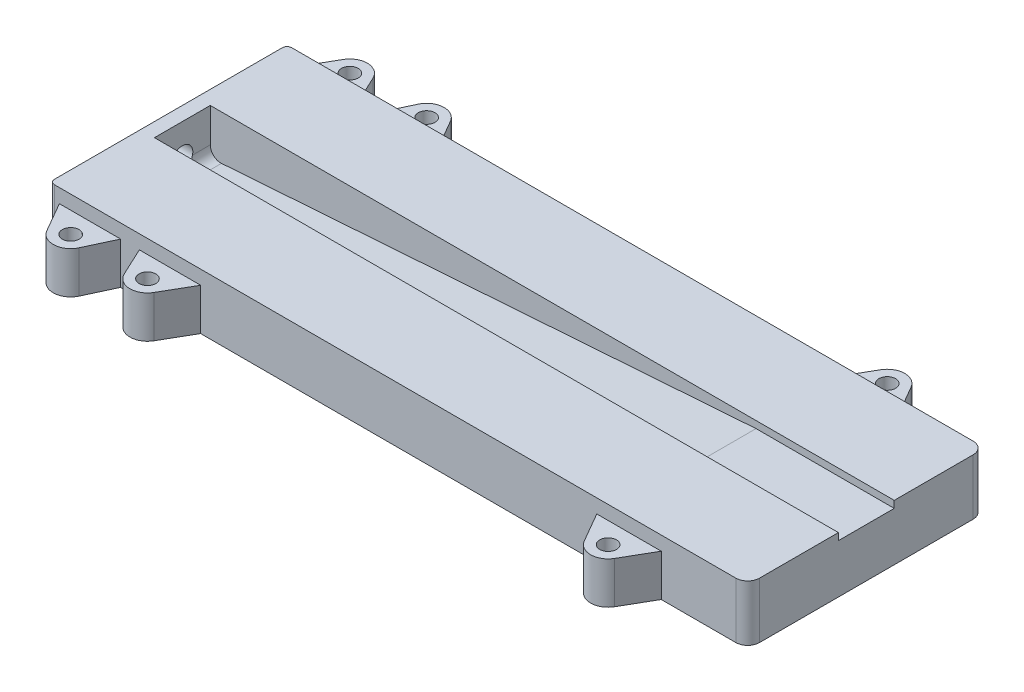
ISO-10303-21;
HEADER;
FILE_DESCRIPTION(('STEP AP214'),'2;1');
FILE_NAME('part.step','',(''),(''),'','','');
FILE_SCHEMA(('AUTOMOTIVE_DESIGN { 1 0 10303 214 1 1 1 1 }'));
ENDSEC;
DATA;
#1=APPLICATION_CONTEXT('core data for automotive mechanical design processes');
#2=APPLICATION_PROTOCOL_DEFINITION('international standard','automotive_design',2000,#1);
#3=PRODUCT_CONTEXT('',#1,'mechanical');
#4=PRODUCT('Part','Part','',(#3));
#5=PRODUCT_RELATED_PRODUCT_CATEGORY('part','',(#4));
#6=PRODUCT_DEFINITION_FORMATION('','',#4);
#7=PRODUCT_DEFINITION_CONTEXT('part definition',#1,'design');
#8=PRODUCT_DEFINITION('design','',#6,#7);
#9=PRODUCT_DEFINITION_SHAPE('','',#8);
#10=(LENGTH_UNIT() NAMED_UNIT(*) SI_UNIT(.MILLI.,.METRE.));
#11=(NAMED_UNIT(*) PLANE_ANGLE_UNIT() SI_UNIT($,.RADIAN.));
#12=(NAMED_UNIT(*) SI_UNIT($,.STERADIAN.) SOLID_ANGLE_UNIT());
#13=UNCERTAINTY_MEASURE_WITH_UNIT(LENGTH_MEASURE(1.E-05),#10,'distance_accuracy_value','');
#14=(GEOMETRIC_REPRESENTATION_CONTEXT(3) GLOBAL_UNCERTAINTY_ASSIGNED_CONTEXT((#13)) GLOBAL_UNIT_ASSIGNED_CONTEXT((#10,
#11,#12)) REPRESENTATION_CONTEXT('',''));
#15=CARTESIAN_POINT('',(0.,0.,0.));
#16=DIRECTION('',(0.,0.,1.));
#17=DIRECTION('',(1.,0.,0.));
#18=AXIS2_PLACEMENT_3D('',#15,#16,#17);
#19=CARTESIAN_POINT('',(34.9999999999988,31.0920413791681,-40.));
#20=DIRECTION('',(0.,0.,1.));
#21=DIRECTION('',(1.,0.,0.));
#22=AXIS2_PLACEMENT_3D('',#19,#20,#21);
#23=CYLINDRICAL_SURFACE('',#22,14.9999999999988);
#24=CARTESIAN_POINT('',(34.9999999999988,31.0920413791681,40.));
#25=DIRECTION('',(0.,0.,1.));
#26=DIRECTION('',(1.,0.,0.));
#27=AXIS2_PLACEMENT_3D('',#24,#25,#26);
#28=CIRCLE('',#27,14.9999999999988);
#29=CARTESIAN_POINT('',(20.,31.0920413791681,40.));
#30=VERTEX_POINT('',#29);
#31=CARTESIAN_POINT('',(36.0523875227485,16.129004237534,40.));
#32=VERTEX_POINT('',#31);
#33=EDGE_CURVE('E252',#30,#32,#28,.T.);
#34=ORIENTED_EDGE('',*,*,#33,.T.);
#35=DIRECTION('',(0.,0.,1.));
#36=VECTOR('',#35,1.);
#37=CARTESIAN_POINT('',(36.052387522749,16.129004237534,-40.));
#38=LINE('',#37,#36);
#39=CARTESIAN_POINT('',(36.0523875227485,16.129004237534,-40.));
#40=VERTEX_POINT('',#39);
#41=EDGE_CURVE('E400',#32,#40,#38,.F.);
#42=ORIENTED_EDGE('',*,*,#41,.T.);
#43=CARTESIAN_POINT('',(34.9999999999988,31.0920413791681,-40.));
#44=DIRECTION('',(0.,0.,1.));
#45=DIRECTION('',(1.,0.,0.));
#46=AXIS2_PLACEMENT_3D('',#43,#44,#45);
#47=CIRCLE('',#46,14.9999999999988);
#48=CARTESIAN_POINT('',(20.,31.0920413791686,-40.));
#49=VERTEX_POINT('',#48);
#50=EDGE_CURVE('E214',#49,#40,#47,.T.);
#51=ORIENTED_EDGE('',*,*,#50,.F.);
#52=DIRECTION('',(0.,0.,1.));
#53=VECTOR('',#52,1.);
#54=CARTESIAN_POINT('',(20.,31.092041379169,-40.));
#55=LINE('',#54,#53);
#56=CARTESIAN_POINT('',(20.,31.0920413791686,-14.4819839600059));
#57=VERTEX_POINT('',#56);
#58=EDGE_CURVE('E204',#49,#57,#55,.T.);
#59=ORIENTED_EDGE('',*,*,#58,.T.);
#60=CARTESIAN_POINT('',(20.,31.0920413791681,-14.4819839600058));
#61=CARTESIAN_POINT('',(19.9999971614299,30.9140898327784,-14.4339669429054));
#62=CARTESIAN_POINT('',(20.0031674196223,30.7370597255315,-14.3826725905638));
#63=CARTESIAN_POINT('',(20.0156286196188,30.3852278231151,-14.2736743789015));
#64=CARTESIAN_POINT('',(20.0249186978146,30.2104257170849,-14.2159714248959));
#65=CARTESIAN_POINT('',(20.0615940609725,29.6904006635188,-14.0336336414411));
#66=CARTESIAN_POINT('',(20.0977858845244,29.3490068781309,-13.8996206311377));
#67=CARTESIAN_POINT('',(20.1909918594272,28.6825730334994,-13.6095947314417));
#68=CARTESIAN_POINT('',(20.2478109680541,28.3574112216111,-13.4537960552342));
#69=CARTESIAN_POINT('',(20.3798785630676,27.7219702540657,-13.1209359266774));
#70=CARTESIAN_POINT('',(20.4551325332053,27.411695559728,-12.9438681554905));
#71=CARTESIAN_POINT('',(20.6210460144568,26.8091871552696,-12.5712148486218));
#72=CARTESIAN_POINT('',(20.7116238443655,26.5168684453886,-12.3757298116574));
#73=CARTESIAN_POINT('',(20.9058715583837,25.949527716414,-11.9670871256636));
#74=CARTESIAN_POINT('',(21.0095405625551,25.6745045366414,-11.7539306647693));
#75=CARTESIAN_POINT('',(21.2276997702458,25.1416770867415,-11.3107851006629));
#76=CARTESIAN_POINT('',(21.3422168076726,24.883918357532,-11.0807545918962));
#77=CARTESIAN_POINT('',(21.5793156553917,24.3867374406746,-10.6055150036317));
#78=CARTESIAN_POINT('',(21.7018985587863,24.1473177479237,-10.3603038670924));
#79=CARTESIAN_POINT('',(21.9708925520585,23.6534576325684,-9.81881697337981));
#80=CARTESIAN_POINT('',(22.1181692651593,23.4019290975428,-9.52031324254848));
#81=CARTESIAN_POINT('',(22.4160735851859,22.9235530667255,-8.90567941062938));
#82=CARTESIAN_POINT('',(22.566701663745,22.6967090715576,-8.58954681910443));
#83=CARTESIAN_POINT('',(22.8671774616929,22.2680326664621,-7.94030023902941));
#84=CARTESIAN_POINT('',(23.0170250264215,22.066205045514,-7.60718301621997));
#85=CARTESIAN_POINT('',(23.3113310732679,21.6881930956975,-6.92445085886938));
#86=CARTESIAN_POINT('',(23.4557904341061,21.5120045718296,-6.57483863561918));
#87=CARTESIAN_POINT('',(23.7121858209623,21.2118668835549,-5.91582433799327));
#88=CARTESIAN_POINT('',(23.8256581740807,21.0840612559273,-5.60877573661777));
#89=CARTESIAN_POINT('',(24.0416006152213,20.8480643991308,-4.98341146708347));
#90=CARTESIAN_POINT('',(24.1440708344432,20.7398729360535,-4.66509593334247));
#91=CARTESIAN_POINT('',(24.3339494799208,20.5443440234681,-4.01844049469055));
#92=CARTESIAN_POINT('',(24.4213879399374,20.4569648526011,-3.69012215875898));
#93=CARTESIAN_POINT('',(24.5774026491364,20.3040181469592,-3.02403340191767));
#94=CARTESIAN_POINT('',(24.6459834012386,20.2384454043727,-2.68626525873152));
#95=CARTESIAN_POINT('',(24.7509580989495,20.1393503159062,-2.06013542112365));
#96=CARTESIAN_POINT('',(24.790809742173,20.1023096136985,-1.77290994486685));
#97=CARTESIAN_POINT('',(24.8530101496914,20.0448511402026,-1.1949156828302));
#98=CARTESIAN_POINT('',(24.875361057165,20.0244313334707,-0.904147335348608));
#99=CARTESIAN_POINT('',(24.9014657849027,20.0006066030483,-0.321270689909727));
#100=CARTESIAN_POINT('',(24.9052323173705,19.9971900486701,-0.0291634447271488));
#101=CARTESIAN_POINT('',(24.8940136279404,20.0074081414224,0.554396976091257));
#102=CARTESIAN_POINT('',(24.8790277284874,20.0210434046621,0.845850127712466));
#103=CARTESIAN_POINT('',(24.8311237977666,20.0650292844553,1.42504255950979));
#104=CARTESIAN_POINT('',(24.7982629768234,20.0953265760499,1.71279070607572));
#105=CARTESIAN_POINT('',(24.7161629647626,20.1720672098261,2.28372373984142));
#106=CARTESIAN_POINT('',(24.6669236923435,20.2185106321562,2.56690860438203));
#107=CARTESIAN_POINT('',(24.554008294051,20.3269415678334,3.12779192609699));
#108=CARTESIAN_POINT('',(24.4903101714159,20.3889527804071,3.40548131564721));
#109=CARTESIAN_POINT('',(24.3507843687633,20.5277671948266,3.9540582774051));
#110=CARTESIAN_POINT('',(24.2749533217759,20.6045745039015,4.2249439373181));
#111=CARTESIAN_POINT('',(24.0722109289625,20.8151588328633,4.89584713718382));
#112=CARTESIAN_POINT('',(23.9389946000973,20.9579946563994,5.29113966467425));
#113=CARTESIAN_POINT('',(23.6575751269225,21.2739876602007,6.0639118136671));
#114=CARTESIAN_POINT('',(23.5093647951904,21.4471594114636,6.44138276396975));
#115=CARTESIAN_POINT('',(23.2042073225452,21.8228471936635,7.17872933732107));
#116=CARTESIAN_POINT('',(23.0472438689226,22.025419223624,7.53856958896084));
#117=CARTESIAN_POINT('',(22.7305566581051,22.4588032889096,8.23942455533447));
#118=CARTESIAN_POINT('',(22.570833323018,22.689611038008,8.58044211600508));
#119=CARTESIAN_POINT('',(22.24919383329,23.1859145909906,9.25238912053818));
#120=CARTESIAN_POINT('',(22.087342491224,23.4522038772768,9.58276447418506));
#121=CARTESIAN_POINT('',(21.7711242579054,24.0138545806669,10.22181778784));
#122=CARTESIAN_POINT('',(21.6167583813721,24.3092199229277,10.530492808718));
#123=CARTESIAN_POINT('',(21.3207083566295,24.9280758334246,11.1238396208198));
#124=CARTESIAN_POINT('',(21.1790047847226,25.2515217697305,11.4085481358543));
#125=CARTESIAN_POINT('',(20.9129751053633,25.9260895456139,11.9520529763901));
#126=CARTESIAN_POINT('',(20.788642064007,26.2772002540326,12.2108596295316));
#127=CARTESIAN_POINT('',(20.5903782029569,26.9153069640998,12.6390897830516));
#128=CARTESIAN_POINT('',(20.5115936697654,27.1966179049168,12.8147659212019));
#129=CARTESIAN_POINT('',(20.3687588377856,27.7731644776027,13.1485265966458));
#130=CARTESIAN_POINT('',(20.3047091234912,28.0684006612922,13.306610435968));
#131=CARTESIAN_POINT('',(20.1935779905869,28.6705983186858,13.6033478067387));
#132=CARTESIAN_POINT('',(20.1464528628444,28.9775272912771,13.7420508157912));
#133=CARTESIAN_POINT('',(20.0708934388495,29.6019003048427,13.9990833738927));
#134=CARTESIAN_POINT('',(20.0424469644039,29.9193373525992,14.117426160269));
#135=CARTESIAN_POINT('',(20.0161854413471,30.3813167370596,14.2719915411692));
#136=CARTESIAN_POINT('',(20.0101417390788,30.5225562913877,14.3169299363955));
#137=CARTESIAN_POINT('',(20.0020496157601,30.8063465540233,14.4026117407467));
#138=CARTESIAN_POINT('',(19.9999994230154,30.948896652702,14.4433570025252));
#139=CARTESIAN_POINT('',(20.,31.0920413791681,14.4819839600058));
#140=B_SPLINE_CURVE_WITH_KNOTS('',3,(#60,#61,#62,#63,#64,#65,#66,#67,#68,#69,#70,#71,#72,#73,
#74,#75,#76,#77,#78,#79,#80,#81,#82,#83,#84,#85,#86,#87,#88,#89,#90,#91,#92,#93,#94,#95,#96,#97,
#98,#99,#100,#101,#102,#103,#104,#105,#106,#107,#108,#109,#110,#111,#112,#113,#114,#115,#116,
#117,#118,#119,#120,#121,#122,#123,#124,#125,#126,#127,#128,#129,#130,#131,#132,#133,#134,#135,
#136,#137,#138,#139),.UNSPECIFIED.,.F.,.F.,(4,2,2,2,2,2,2,2,2,2,2,2,2,2,2,2,2,2,2,2,2,2,2,2,2,2,
2,2,2,2,2,2,2,2,2,2,2,2,2,4),(0.,0.552822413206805,1.10556683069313,2.20934739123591,
3.30295190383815,4.39688212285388,5.48515516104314,6.57335508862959,7.66432082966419,
8.75543472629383,10.005879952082,11.2565022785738,12.5073636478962,13.7580201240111,
14.8114479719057,15.8648632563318,16.916148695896,17.9671828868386,18.8432415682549,
19.7191929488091,20.5945450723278,21.4699288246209,22.34252717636,23.2151298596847,
24.0890690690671,24.9632512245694,26.2840070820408,27.6053990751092,28.9293417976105,
30.2530837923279,31.6140836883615,32.9752675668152,34.3343262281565,35.6928408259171,
36.7145574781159,37.7363146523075,38.7554137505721,39.7738477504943,40.2187665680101,
40.6634879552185),.UNSPECIFIED.);
#141=CARTESIAN_POINT('',(20.,31.0920413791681,14.4819839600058));
#142=VERTEX_POINT('',#141);
#143=EDGE_CURVE('E20',#57,#142,#140,.T.);
#144=ORIENTED_EDGE('',*,*,#143,.T.);
#145=DIRECTION('',(0.,0.,1.));
#146=VECTOR('',#145,1.);
#147=CARTESIAN_POINT('',(20.,31.0920413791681,-40.));
#148=LINE('',#147,#146);
#149=EDGE_CURVE('E207',#142,#30,#148,.T.);
#150=ORIENTED_EDGE('',*,*,#149,.T.);
#151=EDGE_LOOP('',(#34,#42,#51,#59,#144,#150));
#152=FACE_BOUND('',#151,.T.);
#153=ADVANCED_FACE('F16',(#152),#23,.F.);
#154=CARTESIAN_POINT('',(36.052387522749,16.129004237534,-40.));
#155=DIRECTION('',(0.0701591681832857,-0.997535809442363,0.));
#156=DIRECTION('',(0.997535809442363,0.0701591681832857,0.));
#157=AXIS2_PLACEMENT_3D('',#154,#155,#156);
#158=PLANE('',#157);
#159=DIRECTION('',(0.997535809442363,0.0701591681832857,0.));
#160=VECTOR('',#159,1.);
#161=CARTESIAN_POINT('',(36.052387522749,16.129004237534,40.));
#162=LINE('',#161,#160);
#163=CARTESIAN_POINT('',(802.,70.,40.));
#164=VERTEX_POINT('',#163);
#165=EDGE_CURVE('E253',#32,#164,#162,.T.);
#166=ORIENTED_EDGE('',*,*,#165,.T.);
#167=DIRECTION('',(0.,0.,-1.));
#168=VECTOR('',#167,1.);
#169=CARTESIAN_POINT('',(802.,70.,-40.));
#170=LINE('',#169,#168);
#171=CARTESIAN_POINT('',(802.,70.,-40.));
#172=VERTEX_POINT('',#171);
#173=EDGE_CURVE('E209',#164,#172,#170,.T.);
#174=ORIENTED_EDGE('',*,*,#173,.T.);
#175=DIRECTION('',(0.997535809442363,0.0701591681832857,0.));
#176=VECTOR('',#175,1.);
#177=CARTESIAN_POINT('',(36.052387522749,16.129004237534,-40.));
#178=LINE('',#177,#176);
#179=EDGE_CURVE('E250',#40,#172,#178,.T.);
#180=ORIENTED_EDGE('',*,*,#179,.F.);
#181=ORIENTED_EDGE('',*,*,#41,.F.);
#182=EDGE_LOOP('',(#166,#174,#180,#181));
#183=FACE_BOUND('',#182,.T.);
#184=ADVANCED_FACE('F976',(#183),#158,.F.);
#185=CARTESIAN_POINT('',(20.,85.,-40.));
#186=DIRECTION('',(-1.,0.,0.));
#187=DIRECTION('',(0.,0.,1.));
#188=AXIS2_PLACEMENT_3D('',#185,#186,#187);
#189=PLANE('',#188);
#190=ORIENTED_EDGE('',*,*,#58,.F.);
#191=DIRECTION('',(0.,1.,0.));
#192=VECTOR('',#191,1.);
#193=CARTESIAN_POINT('',(20.,0.,-40.));
#194=LINE('',#193,#192);
#195=CARTESIAN_POINT('',(20.,80.,-40.));
#196=VERTEX_POINT('',#195);
#197=EDGE_CURVE('E251',#196,#49,#194,.F.);
#198=ORIENTED_EDGE('',*,*,#197,.F.);
#199=DIRECTION('',(0.,0.,1.));
#200=VECTOR('',#199,1.);
#201=CARTESIAN_POINT('',(20.,80.,0.));
#202=LINE('',#201,#200);
#203=CARTESIAN_POINT('',(20.,80.,40.));
#204=VERTEX_POINT('',#203);
#205=EDGE_CURVE('E395',#204,#196,#202,.F.);
#206=ORIENTED_EDGE('',*,*,#205,.F.);
#207=DIRECTION('',(0.,1.,0.));
#208=VECTOR('',#207,1.);
#209=CARTESIAN_POINT('',(20.,0.,40.));
#210=LINE('',#209,#208);
#211=EDGE_CURVE('E254',#204,#30,#210,.F.);
#212=ORIENTED_EDGE('',*,*,#211,.T.);
#213=ORIENTED_EDGE('',*,*,#149,.F.);
#214=CARTESIAN_POINT('',(20.,35.,0.));
#215=DIRECTION('',(1.,0.,0.));
#216=DIRECTION('',(0.,0.,-1.));
#217=AXIS2_PLACEMENT_3D('',#214,#215,#216);
#218=CIRCLE('',#217,15.);
#219=EDGE_CURVE('E198',#142,#57,#218,.F.);
#220=ORIENTED_EDGE('',*,*,#219,.T.);
#221=EDGE_LOOP('',(#190,#198,#206,#212,#213,#220));
#222=FACE_BOUND('',#221,.T.);
#223=ADVANCED_FACE('F202',(#222),#189,.F.);
#224=CARTESIAN_POINT('',(-25.,35.,0.));
#225=DIRECTION('',(1.,0.,0.));
#226=DIRECTION('',(0.,0.,-1.));
#227=AXIS2_PLACEMENT_3D('',#224,#225,#226);
#228=CYLINDRICAL_SURFACE('',#227,15.);
#229=ORIENTED_EDGE('',*,*,#219,.F.);
#230=ORIENTED_EDGE('',*,*,#143,.F.);
#231=EDGE_LOOP('',(#229,#230));
#232=FACE_BOUND('',#231,.T.);
#233=CARTESIAN_POINT('',(0.,35.,0.));
#234=DIRECTION('',(1.,0.,0.));
#235=DIRECTION('',(0.,0.,-1.));
#236=AXIS2_PLACEMENT_3D('',#233,#234,#235);
#237=CIRCLE('',#236,15.);
#238=CARTESIAN_POINT('',(0.,35.,-15.));
#239=VERTEX_POINT('',#238);
#240=EDGE_CURVE('E222',#239,#239,#237,.T.);
#241=ORIENTED_EDGE('',*,*,#240,.F.);
#242=EDGE_LOOP('',(#241));
#243=FACE_BOUND('',#242,.T.);
#244=ADVANCED_FACE('F216',(#232,#243),#228,.F.);
#245=CARTESIAN_POINT('',(802.,70.,-40.));
#246=DIRECTION('',(0.,-1.,0.));
#247=DIRECTION('',(0.,0.,-1.));
#248=AXIS2_PLACEMENT_3D('',#245,#246,#247);
#249=PLANE('',#248);
#250=ORIENTED_EDGE('',*,*,#173,.F.);
#251=DIRECTION('',(1.,0.,0.));
#252=VECTOR('',#251,1.);
#253=CARTESIAN_POINT('',(0.,70.,40.));
#254=LINE('',#253,#252);
#255=CARTESIAN_POINT('',(1000.,70.,40.));
#256=VERTEX_POINT('',#255);
#257=EDGE_CURVE('E257',#164,#256,#254,.T.);
#258=ORIENTED_EDGE('',*,*,#257,.T.);
#259=DIRECTION('',(0.,0.,-1.));
#260=VECTOR('',#259,1.);
#261=CARTESIAN_POINT('',(1000.,70.,152.999999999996));
#262=LINE('',#261,#260);
#263=CARTESIAN_POINT('',(1000.,70.,-40.));
#264=VERTEX_POINT('',#263);
#265=EDGE_CURVE('E273',#264,#256,#262,.F.);
#266=ORIENTED_EDGE('',*,*,#265,.F.);
#267=DIRECTION('',(1.,0.,0.));
#268=VECTOR('',#267,1.);
#269=CARTESIAN_POINT('',(0.,70.,-40.));
#270=LINE('',#269,#268);
#271=EDGE_CURVE('E280',#172,#264,#270,.T.);
#272=ORIENTED_EDGE('',*,*,#271,.F.);
#273=EDGE_LOOP('',(#250,#258,#266,#272));
#274=FACE_BOUND('',#273,.T.);
#275=ADVANCED_FACE('F219',(#274),#249,.F.);
#276=CARTESIAN_POINT('',(0.,0.,40.));
#277=DIRECTION('',(0.,0.,1.));
#278=DIRECTION('',(1.,0.,0.));
#279=AXIS2_PLACEMENT_3D('',#276,#277,#278);
#280=PLANE('',#279);
#281=ORIENTED_EDGE('',*,*,#257,.F.);
#282=ORIENTED_EDGE('',*,*,#165,.F.);
#283=ORIENTED_EDGE('',*,*,#33,.F.);
#284=ORIENTED_EDGE('',*,*,#211,.F.);
#285=DIRECTION('',(1.,0.,0.));
#286=VECTOR('',#285,1.);
#287=CARTESIAN_POINT('',(0.,80.,40.));
#288=LINE('',#287,#286);
#289=CARTESIAN_POINT('',(1000.,80.,40.));
#290=VERTEX_POINT('',#289);
#291=EDGE_CURVE('E283',#290,#204,#288,.F.);
#292=ORIENTED_EDGE('',*,*,#291,.F.);
#293=DIRECTION('',(0.,1.,0.));
#294=VECTOR('',#293,1.);
#295=CARTESIAN_POINT('',(1000.,0.,40.));
#296=LINE('',#295,#294);
#297=EDGE_CURVE('E276',#256,#290,#296,.T.);
#298=ORIENTED_EDGE('',*,*,#297,.F.);
#299=EDGE_LOOP('',(#281,#282,#283,#284,#292,#298));
#300=FACE_BOUND('',#299,.T.);
#301=ADVANCED_FACE('F593',(#300),#280,.F.);
#302=CARTESIAN_POINT('',(0.,0.,-40.));
#303=DIRECTION('',(0.,0.,1.));
#304=DIRECTION('',(1.,0.,0.));
#305=AXIS2_PLACEMENT_3D('',#302,#303,#304);
#306=PLANE('',#305);
#307=DIRECTION('',(0.,1.,0.));
#308=VECTOR('',#307,1.);
#309=CARTESIAN_POINT('',(1000.,0.,-40.));
#310=LINE('',#309,#308);
#311=CARTESIAN_POINT('',(1000.,80.,-40.));
#312=VERTEX_POINT('',#311);
#313=EDGE_CURVE('E551',#312,#264,#310,.F.);
#314=ORIENTED_EDGE('',*,*,#313,.F.);
#315=DIRECTION('',(1.,0.,0.));
#316=VECTOR('',#315,1.);
#317=CARTESIAN_POINT('',(0.,80.,-40.));
#318=LINE('',#317,#316);
#319=EDGE_CURVE('E350',#196,#312,#318,.T.);
#320=ORIENTED_EDGE('',*,*,#319,.F.);
#321=ORIENTED_EDGE('',*,*,#197,.T.);
#322=ORIENTED_EDGE('',*,*,#50,.T.);
#323=ORIENTED_EDGE('',*,*,#179,.T.);
#324=ORIENTED_EDGE('',*,*,#271,.T.);
#325=EDGE_LOOP('',(#314,#320,#321,#322,#323,#324));
#326=FACE_BOUND('',#325,.T.);
#327=ADVANCED_FACE('F972',(#326),#306,.T.);
#328=CARTESIAN_POINT('',(0.,80.,0.));
#329=DIRECTION('',(0.,1.,0.));
#330=DIRECTION('',(0.,0.,1.));
#331=AXIS2_PLACEMENT_3D('',#328,#329,#330);
#332=PLANE('',#331);
#333=ORIENTED_EDGE('',*,*,#205,.T.);
#334=ORIENTED_EDGE('',*,*,#319,.T.);
#335=DIRECTION('',(0.,0.,-1.));
#336=VECTOR('',#335,1.);
#337=CARTESIAN_POINT('',(1000.,80.,152.999999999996));
#338=LINE('',#337,#336);
#339=CARTESIAN_POINT('',(1000.,80.,-152.999999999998));
#340=VERTEX_POINT('',#339);
#341=EDGE_CURVE('E548',#340,#312,#338,.F.);
#342=ORIENTED_EDGE('',*,*,#341,.F.);
#343=CARTESIAN_POINT('',(982.999999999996,80.,-152.999999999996));
#344=DIRECTION('',(0.,1.,0.));
#345=DIRECTION('',(0.,0.,1.));
#346=AXIS2_PLACEMENT_3D('',#343,#344,#345);
#347=CIRCLE('',#346,17.0000000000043);
#348=CARTESIAN_POINT('',(982.999999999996,80.,-170.));
#349=VERTEX_POINT('',#348);
#350=EDGE_CURVE('E484',#349,#340,#347,.F.);
#351=ORIENTED_EDGE('',*,*,#350,.F.);
#352=DIRECTION('',(1.,0.,0.));
#353=VECTOR('',#352,1.);
#354=CARTESIAN_POINT('',(982.999999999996,80.,-170.));
#355=LINE('',#354,#353);
#356=CARTESIAN_POINT('',(6.7999999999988,80.,-170.));
#357=VERTEX_POINT('',#356);
#358=EDGE_CURVE('E508',#357,#349,#355,.T.);
#359=ORIENTED_EDGE('',*,*,#358,.F.);
#360=CARTESIAN_POINT('',(6.79999999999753,80.,-163.200000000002));
#361=DIRECTION('',(0.,1.,0.));
#362=DIRECTION('',(0.,0.,1.));
#363=AXIS2_PLACEMENT_3D('',#360,#361,#362);
#364=CIRCLE('',#363,6.79999999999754);
#365=CARTESIAN_POINT('',(0.,80.,-163.200000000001));
#366=VERTEX_POINT('',#365);
#367=EDGE_CURVE('E233',#366,#357,#364,.F.);
#368=ORIENTED_EDGE('',*,*,#367,.F.);
#369=DIRECTION('',(0.,0.,1.));
#370=VECTOR('',#369,1.);
#371=CARTESIAN_POINT('',(0.,80.,-163.2));
#372=LINE('',#371,#370);
#373=CARTESIAN_POINT('',(0.,80.,163.200000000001));
#374=VERTEX_POINT('',#373);
#375=EDGE_CURVE('E229',#374,#366,#372,.F.);
#376=ORIENTED_EDGE('',*,*,#375,.F.);
#377=CARTESIAN_POINT('',(6.79999999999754,80.,163.200000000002));
#378=DIRECTION('',(0.,1.,0.));
#379=DIRECTION('',(0.,0.,1.));
#380=AXIS2_PLACEMENT_3D('',#377,#378,#379);
#381=CIRCLE('',#380,6.79999999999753);
#382=CARTESIAN_POINT('',(6.79999999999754,80.,170.));
#383=VERTEX_POINT('',#382);
#384=EDGE_CURVE('E224',#383,#374,#381,.F.);
#385=ORIENTED_EDGE('',*,*,#384,.F.);
#386=DIRECTION('',(1.,0.,0.));
#387=VECTOR('',#386,1.);
#388=CARTESIAN_POINT('',(6.79999999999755,80.,170.));
#389=LINE('',#388,#387);
#390=CARTESIAN_POINT('',(982.999999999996,80.,170.));
#391=VERTEX_POINT('',#390);
#392=EDGE_CURVE('E286',#391,#383,#389,.F.);
#393=ORIENTED_EDGE('',*,*,#392,.F.);
#394=CARTESIAN_POINT('',(982.999999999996,80.,152.999999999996));
#395=DIRECTION('',(0.,1.,0.));
#396=DIRECTION('',(0.,0.,1.));
#397=AXIS2_PLACEMENT_3D('',#394,#395,#396);
#398=CIRCLE('',#397,17.0000000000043);
#399=CARTESIAN_POINT('',(1000.,80.,152.999999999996));
#400=VERTEX_POINT('',#399);
#401=EDGE_CURVE('E300',#400,#391,#398,.F.);
#402=ORIENTED_EDGE('',*,*,#401,.F.);
#403=DIRECTION('',(0.,0.,-1.));
#404=VECTOR('',#403,1.);
#405=CARTESIAN_POINT('',(1000.,80.,152.999999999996));
#406=LINE('',#405,#404);
#407=EDGE_CURVE('E571',#290,#400,#406,.F.);
#408=ORIENTED_EDGE('',*,*,#407,.F.);
#409=ORIENTED_EDGE('',*,*,#291,.T.);
#410=EDGE_LOOP('',(#333,#334,#342,#351,#359,#368,#376,#385,#393,#402,#408,#409));
#411=FACE_BOUND('',#410,.T.);
#412=ADVANCED_FACE('F596',(#411),#332,.T.);
#413=CARTESIAN_POINT('',(0.,60.,0.));
#414=DIRECTION('',(0.,1.,0.));
#415=DIRECTION('',(0.,0.,1.));
#416=AXIS2_PLACEMENT_3D('',#413,#414,#415);
#417=PLANE('',#416);
#418=CARTESIAN_POINT('',(830.,60.,-200.000000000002));
#419=DIRECTION('',(0.,1.,0.));
#420=DIRECTION('',(0.,0.,1.));
#421=AXIS2_PLACEMENT_3D('',#418,#419,#420);
#422=CIRCLE('',#421,12.);
#423=CARTESIAN_POINT('',(830.,60.,-188.000000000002));
#424=VERTEX_POINT('',#423);
#425=EDGE_CURVE('E481',#424,#424,#422,.F.);
#426=ORIENTED_EDGE('',*,*,#425,.T.);
#427=EDGE_LOOP('',(#426));
#428=FACE_BOUND('',#427,.T.);
#429=DIRECTION('',(-0.500000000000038,0.,0.866025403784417));
#430=VECTOR('',#429,1.);
#431=CARTESIAN_POINT('',(808.34936490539,60.,-212.5));
#432=LINE('',#431,#430);
#433=CARTESIAN_POINT('',(783.811978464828,60.,-170.));
#434=VERTEX_POINT('',#433);
#435=CARTESIAN_POINT('',(808.349364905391,60.,-212.500000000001));
#436=VERTEX_POINT('',#435);
#437=EDGE_CURVE('E391',#434,#436,#432,.F.);
#438=ORIENTED_EDGE('',*,*,#437,.F.);
#439=DIRECTION('',(1.,0.,0.));
#440=VECTOR('',#439,1.);
#441=CARTESIAN_POINT('',(982.999999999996,60.,-170.));
#442=LINE('',#441,#440);
#443=CARTESIAN_POINT('',(876.188021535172,60.,-170.));
#444=VERTEX_POINT('',#443);
#445=EDGE_CURVE('E236',#444,#434,#442,.F.);
#446=ORIENTED_EDGE('',*,*,#445,.F.);
#447=DIRECTION('',(-0.500000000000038,0.,-0.866025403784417));
#448=VECTOR('',#447,1.);
#449=CARTESIAN_POINT('',(879.07477288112,60.,-165.));
#450=LINE('',#449,#448);
#451=CARTESIAN_POINT('',(851.65063509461,60.,-212.500000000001));
#452=VERTEX_POINT('',#451);
#453=EDGE_CURVE('E248',#452,#444,#450,.F.);
#454=ORIENTED_EDGE('',*,*,#453,.F.);
#455=CARTESIAN_POINT('',(830.,60.,-200.000000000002));
#456=DIRECTION('',(0.,1.,0.));
#457=DIRECTION('',(0.,0.,1.));
#458=AXIS2_PLACEMENT_3D('',#455,#456,#457);
#459=CIRCLE('',#458,24.9999999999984);
#460=EDGE_CURVE('E245',#436,#452,#459,.F.);
#461=ORIENTED_EDGE('',*,*,#460,.F.);
#462=EDGE_LOOP('',(#438,#446,#454,#461));
#463=FACE_BOUND('',#462,.T.);
#464=ADVANCED_FACE('F727',(#428,#463),#417,.T.);
#465=CARTESIAN_POINT('',(0.,60.,0.));
#466=DIRECTION('',(0.,1.,0.));
#467=DIRECTION('',(0.,0.,1.));
#468=AXIS2_PLACEMENT_3D('',#465,#466,#467);
#469=PLANE('',#468);
#470=CARTESIAN_POINT('',(830.,60.,200.000000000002));
#471=DIRECTION('',(0.,1.,0.));
#472=DIRECTION('',(0.,0.,1.));
#473=AXIS2_PLACEMENT_3D('',#470,#471,#472);
#474=CIRCLE('',#473,12.);
#475=CARTESIAN_POINT('',(830.,60.,212.000000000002));
#476=VERTEX_POINT('',#475);
#477=EDGE_CURVE('E478',#476,#476,#474,.F.);
#478=ORIENTED_EDGE('',*,*,#477,.T.);
#479=EDGE_LOOP('',(#478));
#480=FACE_BOUND('',#479,.T.);
#481=DIRECTION('',(0.500000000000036,0.,-0.866025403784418));
#482=VECTOR('',#481,1.);
#483=CARTESIAN_POINT('',(851.65063509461,60.,212.5));
#484=LINE('',#483,#482);
#485=CARTESIAN_POINT('',(876.188021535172,60.,170.));
#486=VERTEX_POINT('',#485);
#487=CARTESIAN_POINT('',(851.65063509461,60.,212.500000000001));
#488=VERTEX_POINT('',#487);
#489=EDGE_CURVE('E341',#486,#488,#484,.F.);
#490=ORIENTED_EDGE('',*,*,#489,.F.);
#491=DIRECTION('',(1.,0.,0.));
#492=VECTOR('',#491,1.);
#493=CARTESIAN_POINT('',(6.79999999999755,60.,170.));
#494=LINE('',#493,#492);
#495=CARTESIAN_POINT('',(783.811978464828,60.,170.));
#496=VERTEX_POINT('',#495);
#497=EDGE_CURVE('E297',#496,#486,#494,.T.);
#498=ORIENTED_EDGE('',*,*,#497,.F.);
#499=DIRECTION('',(0.500000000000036,0.,0.866025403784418));
#500=VECTOR('',#499,1.);
#501=CARTESIAN_POINT('',(780.92522711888,60.,165.));
#502=LINE('',#501,#500);
#503=CARTESIAN_POINT('',(808.34936490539,60.,212.500000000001));
#504=VERTEX_POINT('',#503);
#505=EDGE_CURVE('E290',#504,#496,#502,.F.);
#506=ORIENTED_EDGE('',*,*,#505,.F.);
#507=CARTESIAN_POINT('',(830.,60.,200.000000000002));
#508=DIRECTION('',(0.,1.,0.));
#509=DIRECTION('',(0.,0.,1.));
#510=AXIS2_PLACEMENT_3D('',#507,#508,#509);
#511=CIRCLE('',#510,24.9999999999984);
#512=EDGE_CURVE('E293',#488,#504,#511,.F.);
#513=ORIENTED_EDGE('',*,*,#512,.F.);
#514=EDGE_LOOP('',(#490,#498,#506,#513));
#515=FACE_BOUND('',#514,.T.);
#516=ADVANCED_FACE('F955',(#480,#515),#469,.T.);
#517=CARTESIAN_POINT('',(0.,60.,0.));
#518=DIRECTION('',(0.,1.,0.));
#519=DIRECTION('',(0.,0.,1.));
#520=AXIS2_PLACEMENT_3D('',#517,#518,#519);
#521=PLANE('',#520);
#522=CARTESIAN_POINT('',(169.999999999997,60.,-200.000000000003));
#523=DIRECTION('',(0.,1.,0.));
#524=DIRECTION('',(0.,0.,1.));
#525=AXIS2_PLACEMENT_3D('',#522,#523,#524);
#526=CIRCLE('',#525,12.);
#527=CARTESIAN_POINT('',(169.999999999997,60.,-188.000000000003));
#528=VERTEX_POINT('',#527);
#529=EDGE_CURVE('E475',#528,#528,#526,.F.);
#530=ORIENTED_EDGE('',*,*,#529,.T.);
#531=EDGE_LOOP('',(#530));
#532=FACE_BOUND('',#531,.T.);
#533=DIRECTION('',(-0.422618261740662,0.,0.906307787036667));
#534=VECTOR('',#533,1.);
#535=CARTESIAN_POINT('',(147.34230532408,60.,-210.56545654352));
#536=LINE('',#535,#534);
#537=CARTESIAN_POINT('',(128.426322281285,60.,-170.));
#538=VERTEX_POINT('',#537);
#539=CARTESIAN_POINT('',(147.34230532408,60.,-210.56545654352));
#540=VERTEX_POINT('',#539);
#541=EDGE_CURVE('E375',#538,#540,#536,.F.);
#542=ORIENTED_EDGE('',*,*,#541,.F.);
#543=DIRECTION('',(1.,0.,0.));
#544=VECTOR('',#543,1.);
#545=CARTESIAN_POINT('',(982.999999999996,60.,-170.));
#546=LINE('',#545,#544);
#547=CARTESIAN_POINT('',(216.188021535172,60.,-170.));
#548=VERTEX_POINT('',#547);
#549=EDGE_CURVE('E379',#548,#538,#546,.F.);
#550=ORIENTED_EDGE('',*,*,#549,.F.);
#551=DIRECTION('',(-0.500000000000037,0.,-0.866025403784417));
#552=VECTOR('',#551,1.);
#553=CARTESIAN_POINT('',(219.07477288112,60.,-165.));
#554=LINE('',#553,#552);
#555=CARTESIAN_POINT('',(191.650635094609,60.,-212.500000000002));
#556=VERTEX_POINT('',#555);
#557=EDGE_CURVE('E244',#556,#548,#554,.F.);
#558=ORIENTED_EDGE('',*,*,#557,.F.);
#559=CARTESIAN_POINT('',(169.999999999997,60.,-200.000000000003));
#560=DIRECTION('',(0.,1.,0.));
#561=DIRECTION('',(0.,0.,1.));
#562=AXIS2_PLACEMENT_3D('',#559,#560,#561);
#563=CIRCLE('',#562,25.0000000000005);
#564=EDGE_CURVE('E241',#540,#556,#563,.F.);
#565=ORIENTED_EDGE('',*,*,#564,.F.);
#566=EDGE_LOOP('',(#542,#550,#558,#565));
#567=FACE_BOUND('',#566,.T.);
#568=ADVANCED_FACE('F870',(#532,#567),#521,.T.);
#569=CARTESIAN_POINT('',(0.,60.,0.));
#570=DIRECTION('',(0.,1.,0.));
#571=DIRECTION('',(0.,0.,1.));
#572=AXIS2_PLACEMENT_3D('',#569,#570,#571);
#573=PLANE('',#572);
#574=CARTESIAN_POINT('',(60.0000000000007,60.,-200.000000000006));
#575=DIRECTION('',(0.,1.,0.));
#576=DIRECTION('',(0.,0.,1.));
#577=AXIS2_PLACEMENT_3D('',#574,#575,#576);
#578=CIRCLE('',#577,12.);
#579=CARTESIAN_POINT('',(60.0000000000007,60.,-188.000000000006));
#580=VERTEX_POINT('',#579);
#581=EDGE_CURVE('E472',#580,#580,#578,.F.);
#582=ORIENTED_EDGE('',*,*,#581,.T.);
#583=EDGE_LOOP('',(#582));
#584=FACE_BOUND('',#583,.T.);
#585=DIRECTION('',(-0.499999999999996,0.,0.866025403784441));
#586=VECTOR('',#585,1.);
#587=CARTESIAN_POINT('',(38.349364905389,60.,-212.5));
#588=LINE('',#587,#586);
#589=CARTESIAN_POINT('',(13.8119784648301,60.,-170.));
#590=VERTEX_POINT('',#589);
#591=CARTESIAN_POINT('',(38.3493649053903,60.,-212.500000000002));
#592=VERTEX_POINT('',#591);
#593=EDGE_CURVE('E358',#590,#592,#588,.F.);
#594=ORIENTED_EDGE('',*,*,#593,.F.);
#595=DIRECTION('',(1.,0.,0.));
#596=VECTOR('',#595,1.);
#597=CARTESIAN_POINT('',(982.999999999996,60.,-170.));
#598=LINE('',#597,#596);
#599=CARTESIAN_POINT('',(101.573677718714,60.,-170.));
#600=VERTEX_POINT('',#599);
#601=EDGE_CURVE('E363',#600,#590,#598,.F.);
#602=ORIENTED_EDGE('',*,*,#601,.F.);
#603=DIRECTION('',(-0.422618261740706,0.,-0.906307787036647));
#604=VECTOR('',#603,1.);
#605=CARTESIAN_POINT('',(115.,60.,-141.20715895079));
#606=LINE('',#605,#604);
#607=CARTESIAN_POINT('',(82.6576946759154,60.,-210.565456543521));
#608=VERTEX_POINT('',#607);
#609=EDGE_CURVE('E240',#608,#600,#606,.F.);
#610=ORIENTED_EDGE('',*,*,#609,.F.);
#611=CARTESIAN_POINT('',(60.0000000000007,60.,-200.000000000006));
#612=DIRECTION('',(0.,1.,0.));
#613=DIRECTION('',(0.,0.,1.));
#614=AXIS2_PLACEMENT_3D('',#611,#612,#613);
#615=CIRCLE('',#614,24.9999999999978);
#616=EDGE_CURVE('E237',#592,#608,#615,.F.);
#617=ORIENTED_EDGE('',*,*,#616,.F.);
#618=EDGE_LOOP('',(#594,#602,#610,#617));
#619=FACE_BOUND('',#618,.T.);
#620=ADVANCED_FACE('F890',(#584,#619),#573,.T.);
#621=CARTESIAN_POINT('',(0.,60.,0.));
#622=DIRECTION('',(0.,1.,0.));
#623=DIRECTION('',(0.,0.,1.));
#624=AXIS2_PLACEMENT_3D('',#621,#622,#623);
#625=PLANE('',#624);
#626=CARTESIAN_POINT('',(169.999999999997,60.,200.000000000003));
#627=DIRECTION('',(0.,1.,0.));
#628=DIRECTION('',(0.,0.,1.));
#629=AXIS2_PLACEMENT_3D('',#626,#627,#628);
#630=CIRCLE('',#629,12.);
#631=CARTESIAN_POINT('',(169.999999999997,60.,212.000000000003));
#632=VERTEX_POINT('',#631);
#633=EDGE_CURVE('E469',#632,#632,#630,.F.);
#634=ORIENTED_EDGE('',*,*,#633,.T.);
#635=EDGE_LOOP('',(#634));
#636=FACE_BOUND('',#635,.T.);
#637=DIRECTION('',(0.500000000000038,0.,-0.866025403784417));
#638=VECTOR('',#637,1.);
#639=CARTESIAN_POINT('',(191.65063509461,60.,212.5));
#640=LINE('',#639,#638);
#641=CARTESIAN_POINT('',(216.188021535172,60.,170.));
#642=VERTEX_POINT('',#641);
#643=CARTESIAN_POINT('',(191.650635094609,60.,212.500000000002));
#644=VERTEX_POINT('',#643);
#645=EDGE_CURVE('E304',#642,#644,#640,.F.);
#646=ORIENTED_EDGE('',*,*,#645,.F.);
#647=DIRECTION('',(1.,0.,0.));
#648=VECTOR('',#647,1.);
#649=CARTESIAN_POINT('',(6.79999999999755,60.,170.));
#650=LINE('',#649,#648);
#651=CARTESIAN_POINT('',(128.426322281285,60.,170.));
#652=VERTEX_POINT('',#651);
#653=EDGE_CURVE('E309',#652,#642,#650,.T.);
#654=ORIENTED_EDGE('',*,*,#653,.F.);
#655=DIRECTION('',(0.422618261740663,0.,0.906307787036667));
#656=VECTOR('',#655,1.);
#657=CARTESIAN_POINT('',(115.,60.,141.20715895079));
#658=LINE('',#657,#656);
#659=CARTESIAN_POINT('',(147.34230532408,60.,210.56545654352));
#660=VERTEX_POINT('',#659);
#661=EDGE_CURVE('E316',#660,#652,#658,.F.);
#662=ORIENTED_EDGE('',*,*,#661,.F.);
#663=CARTESIAN_POINT('',(169.999999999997,60.,200.000000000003));
#664=DIRECTION('',(0.,1.,0.));
#665=DIRECTION('',(0.,0.,1.));
#666=AXIS2_PLACEMENT_3D('',#663,#664,#665);
#667=CIRCLE('',#666,25.0000000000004);
#668=EDGE_CURVE('E319',#644,#660,#667,.F.);
#669=ORIENTED_EDGE('',*,*,#668,.F.);
#670=EDGE_LOOP('',(#646,#654,#662,#669));
#671=FACE_BOUND('',#670,.T.);
#672=ADVANCED_FACE('F935',(#636,#671),#625,.T.);
#673=CARTESIAN_POINT('',(0.,60.,0.));
#674=DIRECTION('',(0.,1.,0.));
#675=DIRECTION('',(0.,0.,1.));
#676=AXIS2_PLACEMENT_3D('',#673,#674,#675);
#677=PLANE('',#676);
#678=CARTESIAN_POINT('',(60.0000000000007,60.,200.000000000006));
#679=DIRECTION('',(0.,1.,0.));
#680=DIRECTION('',(0.,0.,1.));
#681=AXIS2_PLACEMENT_3D('',#678,#679,#680);
#682=CIRCLE('',#681,12.);
#683=CARTESIAN_POINT('',(60.0000000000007,60.,212.000000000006));
#684=VERTEX_POINT('',#683);
#685=EDGE_CURVE('E465',#684,#684,#682,.F.);
#686=ORIENTED_EDGE('',*,*,#685,.T.);
#687=EDGE_LOOP('',(#686));
#688=FACE_BOUND('',#687,.T.);
#689=DIRECTION('',(0.422618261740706,0.,-0.906307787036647));
#690=VECTOR('',#689,1.);
#691=CARTESIAN_POINT('',(82.657694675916,60.,210.56545654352));
#692=LINE('',#691,#690);
#693=CARTESIAN_POINT('',(101.573677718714,60.,170.));
#694=VERTEX_POINT('',#693);
#695=CARTESIAN_POINT('',(82.6576946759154,60.,210.565456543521));
#696=VERTEX_POINT('',#695);
#697=EDGE_CURVE('E323',#694,#696,#692,.F.);
#698=ORIENTED_EDGE('',*,*,#697,.F.);
#699=DIRECTION('',(1.,0.,0.));
#700=VECTOR('',#699,1.);
#701=CARTESIAN_POINT('',(6.79999999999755,60.,170.));
#702=LINE('',#701,#700);
#703=CARTESIAN_POINT('',(13.8119784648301,60.,170.));
#704=VERTEX_POINT('',#703);
#705=EDGE_CURVE('E328',#704,#694,#702,.T.);
#706=ORIENTED_EDGE('',*,*,#705,.F.);
#707=DIRECTION('',(0.499999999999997,0.,0.86602540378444));
#708=VECTOR('',#707,1.);
#709=CARTESIAN_POINT('',(10.925227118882,60.,165.));
#710=LINE('',#709,#708);
#711=CARTESIAN_POINT('',(38.3493649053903,60.,212.500000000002));
#712=VERTEX_POINT('',#711);
#713=EDGE_CURVE('E335',#712,#704,#710,.F.);
#714=ORIENTED_EDGE('',*,*,#713,.F.);
#715=CARTESIAN_POINT('',(60.0000000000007,60.,200.000000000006));
#716=DIRECTION('',(0.,1.,0.));
#717=DIRECTION('',(0.,0.,1.));
#718=AXIS2_PLACEMENT_3D('',#715,#716,#717);
#719=CIRCLE('',#718,24.9999999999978);
#720=EDGE_CURVE('E338',#696,#712,#719,.F.);
#721=ORIENTED_EDGE('',*,*,#720,.F.);
#722=EDGE_LOOP('',(#698,#706,#714,#721));
#723=FACE_BOUND('',#722,.T.);
#724=ADVANCED_FACE('F748',(#688,#723),#677,.T.);
#725=CARTESIAN_POINT('',(879.07477288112,0.,-165.));
#726=DIRECTION('',(0.866025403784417,0.,-0.500000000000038));
#727=DIRECTION('',(-0.500000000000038,0.,-0.866025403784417));
#728=AXIS2_PLACEMENT_3D('',#725,#726,#727);
#729=PLANE('',#728);
#730=ORIENTED_EDGE('',*,*,#453,.T.);
#731=DIRECTION('',(0.,1.,0.));
#732=VECTOR('',#731,1.);
#733=CARTESIAN_POINT('',(876.188021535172,0.,-170.));
#734=LINE('',#733,#732);
#735=CARTESIAN_POINT('',(876.188021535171,0.,-170.));
#736=VERTEX_POINT('',#735);
#737=EDGE_CURVE('E355',#736,#444,#734,.T.);
#738=ORIENTED_EDGE('',*,*,#737,.F.);
#739=DIRECTION('',(-0.500000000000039,0.,-0.866025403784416));
#740=VECTOR('',#739,1.);
#741=CARTESIAN_POINT('',(876.188021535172,0.,-170.));
#742=LINE('',#741,#740);
#743=CARTESIAN_POINT('',(851.650635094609,0.,-212.500000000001));
#744=VERTEX_POINT('',#743);
#745=EDGE_CURVE('E464',#736,#744,#742,.T.);
#746=ORIENTED_EDGE('',*,*,#745,.T.);
#747=DIRECTION('',(0.,1.,0.));
#748=VECTOR('',#747,1.);
#749=CARTESIAN_POINT('',(851.65063509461,0.,-212.5));
#750=LINE('',#749,#748);
#751=EDGE_CURVE('E247',#452,#744,#750,.F.);
#752=ORIENTED_EDGE('',*,*,#751,.F.);
#753=EDGE_LOOP('',(#730,#738,#746,#752));
#754=FACE_BOUND('',#753,.T.);
#755=ADVANCED_FACE('F720',(#754),#729,.T.);
#756=CARTESIAN_POINT('',(830.,0.,-200.000000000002));
#757=DIRECTION('',(0.,1.,0.));
#758=DIRECTION('',(0.,0.,1.));
#759=AXIS2_PLACEMENT_3D('',#756,#757,#758);
#760=CYLINDRICAL_SURFACE('',#759,24.9999999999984);
#761=ORIENTED_EDGE('',*,*,#751,.T.);
#762=CARTESIAN_POINT('',(830.,0.,-200.000000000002));
#763=DIRECTION('',(0.,1.,0.));
#764=DIRECTION('',(0.,0.,1.));
#765=AXIS2_PLACEMENT_3D('',#762,#763,#764);
#766=CIRCLE('',#765,24.9999999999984);
#767=CARTESIAN_POINT('',(808.349364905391,0.,-212.500000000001));
#768=VERTEX_POINT('',#767);
#769=EDGE_CURVE('E460',#744,#768,#766,.T.);
#770=ORIENTED_EDGE('',*,*,#769,.T.);
#771=DIRECTION('',(0.,1.,0.));
#772=VECTOR('',#771,1.);
#773=CARTESIAN_POINT('',(808.34936490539,0.,-212.5));
#774=LINE('',#773,#772);
#775=EDGE_CURVE('E388',#436,#768,#774,.F.);
#776=ORIENTED_EDGE('',*,*,#775,.F.);
#777=ORIENTED_EDGE('',*,*,#460,.T.);
#778=EDGE_LOOP('',(#761,#770,#776,#777));
#779=FACE_BOUND('',#778,.T.);
#780=ADVANCED_FACE('F738',(#779),#760,.T.);
#781=CARTESIAN_POINT('',(808.34936490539,0.,-212.5));
#782=DIRECTION('',(-0.866025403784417,0.,-0.500000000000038));
#783=DIRECTION('',(-0.500000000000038,0.,0.866025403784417));
#784=AXIS2_PLACEMENT_3D('',#781,#782,#783);
#785=PLANE('',#784);
#786=DIRECTION('',(-0.50000000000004,0.,0.866025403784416));
#787=VECTOR('',#786,1.);
#788=CARTESIAN_POINT('',(808.34936490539,0.,-212.5));
#789=LINE('',#788,#787);
#790=CARTESIAN_POINT('',(783.811978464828,0.,-170.));
#791=VERTEX_POINT('',#790);
#792=EDGE_CURVE('E463',#768,#791,#789,.T.);
#793=ORIENTED_EDGE('',*,*,#792,.T.);
#794=DIRECTION('',(0.,1.,0.));
#795=VECTOR('',#794,1.);
#796=CARTESIAN_POINT('',(783.811978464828,0.,-170.));
#797=LINE('',#796,#795);
#798=EDGE_CURVE('E512',#434,#791,#797,.F.);
#799=ORIENTED_EDGE('',*,*,#798,.F.);
#800=ORIENTED_EDGE('',*,*,#437,.T.);
#801=ORIENTED_EDGE('',*,*,#775,.T.);
#802=EDGE_LOOP('',(#793,#799,#800,#801));
#803=FACE_BOUND('',#802,.T.);
#804=ADVANCED_FACE('F734',(#803),#785,.T.);
#805=CARTESIAN_POINT('',(219.07477288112,0.,-165.));
#806=DIRECTION('',(0.866025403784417,0.,-0.500000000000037));
#807=DIRECTION('',(-0.500000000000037,0.,-0.866025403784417));
#808=AXIS2_PLACEMENT_3D('',#805,#806,#807);
#809=PLANE('',#808);
#810=ORIENTED_EDGE('',*,*,#557,.T.);
#811=DIRECTION('',(0.,1.,0.));
#812=VECTOR('',#811,1.);
#813=CARTESIAN_POINT('',(216.188021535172,0.,-170.));
#814=LINE('',#813,#812);
#815=CARTESIAN_POINT('',(216.188021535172,0.,-170.));
#816=VERTEX_POINT('',#815);
#817=EDGE_CURVE('E383',#816,#548,#814,.T.);
#818=ORIENTED_EDGE('',*,*,#817,.F.);
#819=DIRECTION('',(-0.500000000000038,0.,-0.866025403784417));
#820=VECTOR('',#819,1.);
#821=CARTESIAN_POINT('',(216.188021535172,0.,-170.));
#822=LINE('',#821,#820);
#823=CARTESIAN_POINT('',(191.650635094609,0.,-212.500000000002));
#824=VERTEX_POINT('',#823);
#825=EDGE_CURVE('E459',#816,#824,#822,.T.);
#826=ORIENTED_EDGE('',*,*,#825,.T.);
#827=DIRECTION('',(0.,1.,0.));
#828=VECTOR('',#827,1.);
#829=CARTESIAN_POINT('',(191.65063509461,0.,-212.5));
#830=LINE('',#829,#828);
#831=EDGE_CURVE('E243',#556,#824,#830,.F.);
#832=ORIENTED_EDGE('',*,*,#831,.F.);
#833=EDGE_LOOP('',(#810,#818,#826,#832));
#834=FACE_BOUND('',#833,.T.);
#835=ADVANCED_FACE('F746',(#834),#809,.T.);
#836=CARTESIAN_POINT('',(169.999999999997,0.,-200.000000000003));
#837=DIRECTION('',(0.,1.,0.));
#838=DIRECTION('',(0.,0.,1.));
#839=AXIS2_PLACEMENT_3D('',#836,#837,#838);
#840=CYLINDRICAL_SURFACE('',#839,25.0000000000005);
#841=ORIENTED_EDGE('',*,*,#831,.T.);
#842=CARTESIAN_POINT('',(169.999999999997,0.,-200.000000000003));
#843=DIRECTION('',(0.,1.,0.));
#844=DIRECTION('',(0.,0.,1.));
#845=AXIS2_PLACEMENT_3D('',#842,#843,#844);
#846=CIRCLE('',#845,25.0000000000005);
#847=CARTESIAN_POINT('',(147.34230532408,0.,-210.56545654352));
#848=VERTEX_POINT('',#847);
#849=EDGE_CURVE('E455',#824,#848,#846,.T.);
#850=ORIENTED_EDGE('',*,*,#849,.T.);
#851=DIRECTION('',(0.,1.,0.));
#852=VECTOR('',#851,1.);
#853=CARTESIAN_POINT('',(147.34230532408,0.,-210.56545654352));
#854=LINE('',#853,#852);
#855=EDGE_CURVE('E372',#540,#848,#854,.F.);
#856=ORIENTED_EDGE('',*,*,#855,.F.);
#857=ORIENTED_EDGE('',*,*,#564,.T.);
#858=EDGE_LOOP('',(#841,#850,#856,#857));
#859=FACE_BOUND('',#858,.T.);
#860=ADVANCED_FACE('F852',(#859),#840,.T.);
#861=CARTESIAN_POINT('',(147.34230532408,0.,-210.56545654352));
#862=DIRECTION('',(-0.906307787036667,0.,-0.422618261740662));
#863=DIRECTION('',(-0.422618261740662,0.,0.906307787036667));
#864=AXIS2_PLACEMENT_3D('',#861,#862,#863);
#865=PLANE('',#864);
#866=DIRECTION('',(-0.422618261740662,0.,0.906307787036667));
#867=VECTOR('',#866,1.);
#868=CARTESIAN_POINT('',(147.34230532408,0.,-210.56545654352));
#869=LINE('',#868,#867);
#870=CARTESIAN_POINT('',(128.426322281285,0.,-170.));
#871=VERTEX_POINT('',#870);
#872=EDGE_CURVE('E458',#848,#871,#869,.T.);
#873=ORIENTED_EDGE('',*,*,#872,.T.);
#874=DIRECTION('',(0.,1.,0.));
#875=VECTOR('',#874,1.);
#876=CARTESIAN_POINT('',(128.426322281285,0.,-170.));
#877=LINE('',#876,#875);
#878=EDGE_CURVE('E382',#538,#871,#877,.F.);
#879=ORIENTED_EDGE('',*,*,#878,.F.);
#880=ORIENTED_EDGE('',*,*,#541,.T.);
#881=ORIENTED_EDGE('',*,*,#855,.T.);
#882=EDGE_LOOP('',(#873,#879,#880,#881));
#883=FACE_BOUND('',#882,.T.);
#884=ADVANCED_FACE('F848',(#883),#865,.T.);
#885=CARTESIAN_POINT('',(115.,0.,-141.20715895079));
#886=DIRECTION('',(0.906307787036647,0.,-0.422618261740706));
#887=DIRECTION('',(-0.422618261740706,0.,-0.906307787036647));
#888=AXIS2_PLACEMENT_3D('',#885,#886,#887);
#889=PLANE('',#888);
#890=ORIENTED_EDGE('',*,*,#609,.T.);
#891=DIRECTION('',(0.,1.,0.));
#892=VECTOR('',#891,1.);
#893=CARTESIAN_POINT('',(101.573677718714,0.,-170.));
#894=LINE('',#893,#892);
#895=CARTESIAN_POINT('',(101.573677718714,0.,-170.));
#896=VERTEX_POINT('',#895);
#897=EDGE_CURVE('E367',#896,#600,#894,.T.);
#898=ORIENTED_EDGE('',*,*,#897,.F.);
#899=DIRECTION('',(-0.422618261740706,0.,-0.906307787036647));
#900=VECTOR('',#899,1.);
#901=CARTESIAN_POINT('',(101.573677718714,0.,-170.));
#902=LINE('',#901,#900);
#903=CARTESIAN_POINT('',(82.6576946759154,0.,-210.565456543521));
#904=VERTEX_POINT('',#903);
#905=EDGE_CURVE('E454',#896,#904,#902,.T.);
#906=ORIENTED_EDGE('',*,*,#905,.T.);
#907=DIRECTION('',(0.,1.,0.));
#908=VECTOR('',#907,1.);
#909=CARTESIAN_POINT('',(82.657694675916,0.,-210.56545654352));
#910=LINE('',#909,#908);
#911=EDGE_CURVE('E239',#608,#904,#910,.F.);
#912=ORIENTED_EDGE('',*,*,#911,.F.);
#913=EDGE_LOOP('',(#890,#898,#906,#912));
#914=FACE_BOUND('',#913,.T.);
#915=ADVANCED_FACE('F844',(#914),#889,.T.);
#916=CARTESIAN_POINT('',(60.0000000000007,0.,-200.000000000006));
#917=DIRECTION('',(0.,1.,0.));
#918=DIRECTION('',(0.,0.,1.));
#919=AXIS2_PLACEMENT_3D('',#916,#917,#918);
#920=CYLINDRICAL_SURFACE('',#919,24.9999999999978);
#921=ORIENTED_EDGE('',*,*,#911,.T.);
#922=CARTESIAN_POINT('',(60.0000000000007,0.,-200.000000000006));
#923=DIRECTION('',(0.,1.,0.));
#924=DIRECTION('',(0.,0.,1.));
#925=AXIS2_PLACEMENT_3D('',#922,#923,#924);
#926=CIRCLE('',#925,24.9999999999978);
#927=CARTESIAN_POINT('',(38.3493649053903,0.,-212.500000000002));
#928=VERTEX_POINT('',#927);
#929=EDGE_CURVE('E450',#904,#928,#926,.T.);
#930=ORIENTED_EDGE('',*,*,#929,.T.);
#931=DIRECTION('',(0.,1.,0.));
#932=VECTOR('',#931,1.);
#933=CARTESIAN_POINT('',(38.349364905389,0.,-212.5));
#934=LINE('',#933,#932);
#935=EDGE_CURVE('E360',#592,#928,#934,.F.);
#936=ORIENTED_EDGE('',*,*,#935,.F.);
#937=ORIENTED_EDGE('',*,*,#616,.T.);
#938=EDGE_LOOP('',(#921,#930,#936,#937));
#939=FACE_BOUND('',#938,.T.);
#940=ADVANCED_FACE('F840',(#939),#920,.T.);
#941=CARTESIAN_POINT('',(38.349364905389,0.,-212.5));
#942=DIRECTION('',(-0.866025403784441,0.,-0.499999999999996));
#943=DIRECTION('',(-0.499999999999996,0.,0.866025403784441));
#944=AXIS2_PLACEMENT_3D('',#941,#942,#943);
#945=PLANE('',#944);
#946=DIRECTION('',(-0.499999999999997,0.,0.866025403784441));
#947=VECTOR('',#946,1.);
#948=CARTESIAN_POINT('',(38.349364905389,0.,-212.5));
#949=LINE('',#948,#947);
#950=CARTESIAN_POINT('',(13.8119784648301,0.,-170.));
#951=VERTEX_POINT('',#950);
#952=EDGE_CURVE('E453',#928,#951,#949,.T.);
#953=ORIENTED_EDGE('',*,*,#952,.T.);
#954=DIRECTION('',(0.,1.,0.));
#955=VECTOR('',#954,1.);
#956=CARTESIAN_POINT('',(13.8119784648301,0.,-170.));
#957=LINE('',#956,#955);
#958=EDGE_CURVE('E366',#590,#951,#957,.F.);
#959=ORIENTED_EDGE('',*,*,#958,.F.);
#960=ORIENTED_EDGE('',*,*,#593,.T.);
#961=ORIENTED_EDGE('',*,*,#935,.T.);
#962=EDGE_LOOP('',(#953,#959,#960,#961));
#963=FACE_BOUND('',#962,.T.);
#964=ADVANCED_FACE('F837',(#963),#945,.T.);
#965=CARTESIAN_POINT('',(982.999999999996,0.,-170.));
#966=DIRECTION('',(0.,0.,-1.));
#967=DIRECTION('',(0.,1.,0.));
#968=AXIS2_PLACEMENT_3D('',#965,#966,#967);
#969=PLANE('',#968);
#970=ORIENTED_EDGE('',*,*,#737,.T.);
#971=ORIENTED_EDGE('',*,*,#445,.T.);
#972=ORIENTED_EDGE('',*,*,#798,.T.);
#973=DIRECTION('',(1.,0.,0.));
#974=VECTOR('',#973,1.);
#975=CARTESIAN_POINT('',(0.,0.,-170.));
#976=LINE('',#975,#974);
#977=EDGE_CURVE('E529',#791,#816,#976,.F.);
#978=ORIENTED_EDGE('',*,*,#977,.T.);
#979=ORIENTED_EDGE('',*,*,#817,.T.);
#980=ORIENTED_EDGE('',*,*,#549,.T.);
#981=ORIENTED_EDGE('',*,*,#878,.T.);
#982=DIRECTION('',(1.,0.,0.));
#983=VECTOR('',#982,1.);
#984=CARTESIAN_POINT('',(0.,0.,-170.));
#985=LINE('',#984,#983);
#986=EDGE_CURVE('E514',#871,#896,#985,.F.);
#987=ORIENTED_EDGE('',*,*,#986,.T.);
#988=ORIENTED_EDGE('',*,*,#897,.T.);
#989=ORIENTED_EDGE('',*,*,#601,.T.);
#990=ORIENTED_EDGE('',*,*,#958,.T.);
#991=DIRECTION('',(1.,0.,0.));
#992=VECTOR('',#991,1.);
#993=CARTESIAN_POINT('',(0.,0.,-170.));
#994=LINE('',#993,#992);
#995=CARTESIAN_POINT('',(6.7999999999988,0.,-170.));
#996=VERTEX_POINT('',#995);
#997=EDGE_CURVE('E449',#951,#996,#994,.F.);
#998=ORIENTED_EDGE('',*,*,#997,.T.);
#999=DIRECTION('',(0.,1.,0.));
#1000=VECTOR('',#999,1.);
#1001=CARTESIAN_POINT('',(6.80000000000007,0.,-170.));
#1002=LINE('',#1001,#1000);
#1003=EDGE_CURVE('E235',#357,#996,#1002,.F.);
#1004=ORIENTED_EDGE('',*,*,#1003,.F.);
#1005=ORIENTED_EDGE('',*,*,#358,.T.);
#1006=DIRECTION('',(0.,1.,0.));
#1007=VECTOR('',#1006,1.);
#1008=CARTESIAN_POINT('',(982.999999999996,0.,-170.));
#1009=LINE('',#1008,#1007);
#1010=CARTESIAN_POINT('',(982.999999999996,0.,-170.));
#1011=VERTEX_POINT('',#1010);
#1012=EDGE_CURVE('E486',#1011,#349,#1009,.T.);
#1013=ORIENTED_EDGE('',*,*,#1012,.F.);
#1014=DIRECTION('',(1.,0.,0.));
#1015=VECTOR('',#1014,1.);
#1016=CARTESIAN_POINT('',(0.,0.,-170.));
#1017=LINE('',#1016,#1015);
#1018=EDGE_CURVE('E468',#1011,#736,#1017,.F.);
#1019=ORIENTED_EDGE('',*,*,#1018,.T.);
#1020=EDGE_LOOP('',(#970,#971,#972,#978,#979,#980,#981,#987,#988,#989,#990,#998,#1004,#1005,
#1013,#1019));
#1021=FACE_BOUND('',#1020,.T.);
#1022=ADVANCED_FACE('F710',(#1021),#969,.T.);
#1023=CARTESIAN_POINT('',(6.79999999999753,0.,-163.200000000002));
#1024=DIRECTION('',(0.,1.,0.));
#1025=DIRECTION('',(0.,0.,1.));
#1026=AXIS2_PLACEMENT_3D('',#1023,#1024,#1025);
#1027=CYLINDRICAL_SURFACE('',#1026,6.79999999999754);
#1028=ORIENTED_EDGE('',*,*,#1003,.T.);
#1029=CARTESIAN_POINT('',(6.79999999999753,0.,-163.200000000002));
#1030=DIRECTION('',(0.,1.,0.));
#1031=DIRECTION('',(0.,0.,1.));
#1032=AXIS2_PLACEMENT_3D('',#1029,#1030,#1031);
#1033=CIRCLE('',#1032,6.79999999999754);
#1034=CARTESIAN_POINT('',(0.,0.,-163.200000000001));
#1035=VERTEX_POINT('',#1034);
#1036=EDGE_CURVE('E446',#996,#1035,#1033,.T.);
#1037=ORIENTED_EDGE('',*,*,#1036,.T.);
#1038=DIRECTION('',(0.,1.,0.));
#1039=VECTOR('',#1038,1.);
#1040=CARTESIAN_POINT('',(0.,0.,-163.2));
#1041=LINE('',#1040,#1039);
#1042=EDGE_CURVE('E225',#366,#1035,#1041,.F.);
#1043=ORIENTED_EDGE('',*,*,#1042,.F.);
#1044=ORIENTED_EDGE('',*,*,#367,.T.);
#1045=EDGE_LOOP('',(#1028,#1037,#1043,#1044));
#1046=FACE_BOUND('',#1045,.T.);
#1047=ADVANCED_FACE('F831',(#1046),#1027,.T.);
#1048=CARTESIAN_POINT('',(0.,0.,-163.2));
#1049=DIRECTION('',(-1.,0.,0.));
#1050=DIRECTION('',(0.,0.,1.));
#1051=AXIS2_PLACEMENT_3D('',#1048,#1049,#1050);
#1052=PLANE('',#1051);
#1053=ORIENTED_EDGE('',*,*,#240,.T.);
#1054=EDGE_LOOP('',(#1053));
#1055=FACE_BOUND('',#1054,.T.);
#1056=ORIENTED_EDGE('',*,*,#1042,.T.);
#1057=DIRECTION('',(0.,0.,1.));
#1058=VECTOR('',#1057,1.);
#1059=CARTESIAN_POINT('',(0.,0.,0.));
#1060=LINE('',#1059,#1058);
#1061=CARTESIAN_POINT('',(0.,0.,163.200000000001));
#1062=VERTEX_POINT('',#1061);
#1063=EDGE_CURVE('E445',#1035,#1062,#1060,.T.);
#1064=ORIENTED_EDGE('',*,*,#1063,.T.);
#1065=DIRECTION('',(0.,1.,0.));
#1066=VECTOR('',#1065,1.);
#1067=CARTESIAN_POINT('',(0.,0.,163.2));
#1068=LINE('',#1067,#1066);
#1069=EDGE_CURVE('E227',#374,#1062,#1068,.F.);
#1070=ORIENTED_EDGE('',*,*,#1069,.F.);
#1071=ORIENTED_EDGE('',*,*,#375,.T.);
#1072=EDGE_LOOP('',(#1056,#1064,#1070,#1071));
#1073=FACE_BOUND('',#1072,.T.);
#1074=ADVANCED_FACE('F827',(#1055,#1073),#1052,.T.);
#1075=CARTESIAN_POINT('',(6.79999999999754,0.,163.200000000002));
#1076=DIRECTION('',(0.,1.,0.));
#1077=DIRECTION('',(0.,0.,1.));
#1078=AXIS2_PLACEMENT_3D('',#1075,#1076,#1077);
#1079=CYLINDRICAL_SURFACE('',#1078,6.79999999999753);
#1080=ORIENTED_EDGE('',*,*,#1069,.T.);
#1081=CARTESIAN_POINT('',(6.79999999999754,0.,163.200000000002));
#1082=DIRECTION('',(0.,1.,0.));
#1083=DIRECTION('',(0.,0.,1.));
#1084=AXIS2_PLACEMENT_3D('',#1081,#1082,#1083);
#1085=CIRCLE('',#1084,6.79999999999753);
#1086=CARTESIAN_POINT('',(6.79999999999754,0.,170.));
#1087=VERTEX_POINT('',#1086);
#1088=EDGE_CURVE('E441',#1062,#1087,#1085,.T.);
#1089=ORIENTED_EDGE('',*,*,#1088,.T.);
#1090=DIRECTION('',(0.,-1.,0.));
#1091=VECTOR('',#1090,1.);
#1092=CARTESIAN_POINT('',(6.79999999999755,0.,170.));
#1093=LINE('',#1092,#1091);
#1094=EDGE_CURVE('E288',#383,#1087,#1093,.T.);
#1095=ORIENTED_EDGE('',*,*,#1094,.F.);
#1096=ORIENTED_EDGE('',*,*,#384,.T.);
#1097=EDGE_LOOP('',(#1080,#1089,#1095,#1096));
#1098=FACE_BOUND('',#1097,.T.);
#1099=ADVANCED_FACE('F823',(#1098),#1079,.T.);
#1100=CARTESIAN_POINT('',(10.925227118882,0.,165.));
#1101=DIRECTION('',(-0.86602540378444,0.,0.499999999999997));
#1102=DIRECTION('',(0.499999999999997,0.,0.86602540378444));
#1103=AXIS2_PLACEMENT_3D('',#1100,#1101,#1102);
#1104=PLANE('',#1103);
#1105=ORIENTED_EDGE('',*,*,#713,.T.);
#1106=DIRECTION('',(0.,-1.,0.));
#1107=VECTOR('',#1106,1.);
#1108=CARTESIAN_POINT('',(13.8119784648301,0.,170.));
#1109=LINE('',#1108,#1107);
#1110=CARTESIAN_POINT('',(13.8119784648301,0.,170.));
#1111=VERTEX_POINT('',#1110);
#1112=EDGE_CURVE('E332',#1111,#704,#1109,.F.);
#1113=ORIENTED_EDGE('',*,*,#1112,.F.);
#1114=DIRECTION('',(0.499999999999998,0.,0.86602540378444));
#1115=VECTOR('',#1114,1.);
#1116=CARTESIAN_POINT('',(13.8119784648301,0.,170.));
#1117=LINE('',#1116,#1115);
#1118=CARTESIAN_POINT('',(38.3493649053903,0.,212.500000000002));
#1119=VERTEX_POINT('',#1118);
#1120=EDGE_CURVE('E440',#1111,#1119,#1117,.T.);
#1121=ORIENTED_EDGE('',*,*,#1120,.T.);
#1122=DIRECTION('',(0.,1.,0.));
#1123=VECTOR('',#1122,1.);
#1124=CARTESIAN_POINT('',(38.349364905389,0.,212.5));
#1125=LINE('',#1124,#1123);
#1126=EDGE_CURVE('E325',#712,#1119,#1125,.F.);
#1127=ORIENTED_EDGE('',*,*,#1126,.F.);
#1128=EDGE_LOOP('',(#1105,#1113,#1121,#1127));
#1129=FACE_BOUND('',#1128,.T.);
#1130=ADVANCED_FACE('F820',(#1129),#1104,.T.);
#1131=CARTESIAN_POINT('',(60.0000000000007,0.,200.000000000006));
#1132=DIRECTION('',(0.,1.,0.));
#1133=DIRECTION('',(0.,0.,1.));
#1134=AXIS2_PLACEMENT_3D('',#1131,#1132,#1133);
#1135=CYLINDRICAL_SURFACE('',#1134,24.9999999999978);
#1136=ORIENTED_EDGE('',*,*,#1126,.T.);
#1137=CARTESIAN_POINT('',(60.0000000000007,0.,200.000000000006));
#1138=DIRECTION('',(0.,1.,0.));
#1139=DIRECTION('',(0.,0.,1.));
#1140=AXIS2_PLACEMENT_3D('',#1137,#1138,#1139);
#1141=CIRCLE('',#1140,24.9999999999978);
#1142=CARTESIAN_POINT('',(82.6576946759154,0.,210.565456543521));
#1143=VERTEX_POINT('',#1142);
#1144=EDGE_CURVE('E436',#1119,#1143,#1141,.T.);
#1145=ORIENTED_EDGE('',*,*,#1144,.T.);
#1146=DIRECTION('',(0.,1.,0.));
#1147=VECTOR('',#1146,1.);
#1148=CARTESIAN_POINT('',(82.657694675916,0.,210.56545654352));
#1149=LINE('',#1148,#1147);
#1150=EDGE_CURVE('E320',#696,#1143,#1149,.F.);
#1151=ORIENTED_EDGE('',*,*,#1150,.F.);
#1152=ORIENTED_EDGE('',*,*,#720,.T.);
#1153=EDGE_LOOP('',(#1136,#1145,#1151,#1152));
#1154=FACE_BOUND('',#1153,.T.);
#1155=ADVANCED_FACE('F817',(#1154),#1135,.T.);
#1156=CARTESIAN_POINT('',(82.657694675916,0.,210.56545654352));
#1157=DIRECTION('',(0.906307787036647,0.,0.422618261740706));
#1158=DIRECTION('',(0.422618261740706,0.,-0.906307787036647));
#1159=AXIS2_PLACEMENT_3D('',#1156,#1157,#1158);
#1160=PLANE('',#1159);
#1161=DIRECTION('',(0.422618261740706,0.,-0.906307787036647));
#1162=VECTOR('',#1161,1.);
#1163=CARTESIAN_POINT('',(82.657694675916,0.,210.56545654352));
#1164=LINE('',#1163,#1162);
#1165=CARTESIAN_POINT('',(101.573677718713,0.,170.));
#1166=VERTEX_POINT('',#1165);
#1167=EDGE_CURVE('E439',#1143,#1166,#1164,.T.);
#1168=ORIENTED_EDGE('',*,*,#1167,.T.);
#1169=DIRECTION('',(0.,-1.,0.));
#1170=VECTOR('',#1169,1.);
#1171=CARTESIAN_POINT('',(101.573677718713,0.,170.));
#1172=LINE('',#1171,#1170);
#1173=EDGE_CURVE('E331',#694,#1166,#1172,.T.);
#1174=ORIENTED_EDGE('',*,*,#1173,.F.);
#1175=ORIENTED_EDGE('',*,*,#697,.T.);
#1176=ORIENTED_EDGE('',*,*,#1150,.T.);
#1177=EDGE_LOOP('',(#1168,#1174,#1175,#1176));
#1178=FACE_BOUND('',#1177,.T.);
#1179=ADVANCED_FACE('F659',(#1178),#1160,.T.);
#1180=CARTESIAN_POINT('',(115.,0.,141.20715895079));
#1181=DIRECTION('',(-0.906307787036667,0.,0.422618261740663));
#1182=DIRECTION('',(0.422618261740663,0.,0.906307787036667));
#1183=AXIS2_PLACEMENT_3D('',#1180,#1181,#1182);
#1184=PLANE('',#1183);
#1185=ORIENTED_EDGE('',*,*,#661,.T.);
#1186=DIRECTION('',(0.,-1.,0.));
#1187=VECTOR('',#1186,1.);
#1188=CARTESIAN_POINT('',(128.426322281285,0.,170.));
#1189=LINE('',#1188,#1187);
#1190=CARTESIAN_POINT('',(128.426322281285,0.,170.));
#1191=VERTEX_POINT('',#1190);
#1192=EDGE_CURVE('E313',#1191,#652,#1189,.F.);
#1193=ORIENTED_EDGE('',*,*,#1192,.F.);
#1194=DIRECTION('',(0.422618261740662,0.,0.906307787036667));
#1195=VECTOR('',#1194,1.);
#1196=CARTESIAN_POINT('',(128.426322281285,0.,170.));
#1197=LINE('',#1196,#1195);
#1198=CARTESIAN_POINT('',(147.34230532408,0.,210.56545654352));
#1199=VERTEX_POINT('',#1198);
#1200=EDGE_CURVE('E435',#1191,#1199,#1197,.T.);
#1201=ORIENTED_EDGE('',*,*,#1200,.T.);
#1202=DIRECTION('',(0.,1.,0.));
#1203=VECTOR('',#1202,1.);
#1204=CARTESIAN_POINT('',(147.34230532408,0.,210.56545654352));
#1205=LINE('',#1204,#1203);
#1206=EDGE_CURVE('E306',#660,#1199,#1205,.F.);
#1207=ORIENTED_EDGE('',*,*,#1206,.F.);
#1208=EDGE_LOOP('',(#1185,#1193,#1201,#1207));
#1209=FACE_BOUND('',#1208,.T.);
#1210=ADVANCED_FACE('F810',(#1209),#1184,.T.);
#1211=CARTESIAN_POINT('',(169.999999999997,0.,200.000000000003));
#1212=DIRECTION('',(0.,1.,0.));
#1213=DIRECTION('',(0.,0.,1.));
#1214=AXIS2_PLACEMENT_3D('',#1211,#1212,#1213);
#1215=CYLINDRICAL_SURFACE('',#1214,25.0000000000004);
#1216=ORIENTED_EDGE('',*,*,#1206,.T.);
#1217=CARTESIAN_POINT('',(169.999999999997,0.,200.000000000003));
#1218=DIRECTION('',(0.,1.,0.));
#1219=DIRECTION('',(0.,0.,1.));
#1220=AXIS2_PLACEMENT_3D('',#1217,#1218,#1219);
#1221=CIRCLE('',#1220,25.0000000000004);
#1222=CARTESIAN_POINT('',(191.650635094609,0.,212.500000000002));
#1223=VERTEX_POINT('',#1222);
#1224=EDGE_CURVE('E431',#1199,#1223,#1221,.T.);
#1225=ORIENTED_EDGE('',*,*,#1224,.T.);
#1226=DIRECTION('',(0.,1.,0.));
#1227=VECTOR('',#1226,1.);
#1228=CARTESIAN_POINT('',(191.65063509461,0.,212.5));
#1229=LINE('',#1228,#1227);
#1230=EDGE_CURVE('E294',#644,#1223,#1229,.F.);
#1231=ORIENTED_EDGE('',*,*,#1230,.F.);
#1232=ORIENTED_EDGE('',*,*,#668,.T.);
#1233=EDGE_LOOP('',(#1216,#1225,#1231,#1232));
#1234=FACE_BOUND('',#1233,.T.);
#1235=ADVANCED_FACE('F806',(#1234),#1215,.T.);
#1236=CARTESIAN_POINT('',(191.65063509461,0.,212.5));
#1237=DIRECTION('',(0.866025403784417,0.,0.500000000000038));
#1238=DIRECTION('',(0.500000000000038,0.,-0.866025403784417));
#1239=AXIS2_PLACEMENT_3D('',#1236,#1237,#1238);
#1240=PLANE('',#1239);
#1241=DIRECTION('',(0.500000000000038,0.,-0.866025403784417));
#1242=VECTOR('',#1241,1.);
#1243=CARTESIAN_POINT('',(191.65063509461,0.,212.5));
#1244=LINE('',#1243,#1242);
#1245=CARTESIAN_POINT('',(216.188021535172,0.,170.));
#1246=VERTEX_POINT('',#1245);
#1247=EDGE_CURVE('E434',#1223,#1246,#1244,.T.);
#1248=ORIENTED_EDGE('',*,*,#1247,.T.);
#1249=DIRECTION('',(0.,-1.,0.));
#1250=VECTOR('',#1249,1.);
#1251=CARTESIAN_POINT('',(216.188021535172,0.,170.));
#1252=LINE('',#1251,#1250);
#1253=EDGE_CURVE('E312',#642,#1246,#1252,.T.);
#1254=ORIENTED_EDGE('',*,*,#1253,.F.);
#1255=ORIENTED_EDGE('',*,*,#645,.T.);
#1256=ORIENTED_EDGE('',*,*,#1230,.T.);
#1257=EDGE_LOOP('',(#1248,#1254,#1255,#1256));
#1258=FACE_BOUND('',#1257,.T.);
#1259=ADVANCED_FACE('F802',(#1258),#1240,.T.);
#1260=CARTESIAN_POINT('',(780.92522711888,0.,165.));
#1261=DIRECTION('',(-0.866025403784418,0.,0.500000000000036));
#1262=DIRECTION('',(0.500000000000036,0.,0.866025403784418));
#1263=AXIS2_PLACEMENT_3D('',#1260,#1261,#1262);
#1264=PLANE('',#1263);
#1265=ORIENTED_EDGE('',*,*,#505,.T.);
#1266=DIRECTION('',(0.,-1.,0.));
#1267=VECTOR('',#1266,1.);
#1268=CARTESIAN_POINT('',(783.811978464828,0.,170.));
#1269=LINE('',#1268,#1267);
#1270=CARTESIAN_POINT('',(783.811978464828,0.,170.));
#1271=VERTEX_POINT('',#1270);
#1272=EDGE_CURVE('E301',#1271,#496,#1269,.F.);
#1273=ORIENTED_EDGE('',*,*,#1272,.F.);
#1274=DIRECTION('',(0.500000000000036,0.,0.866025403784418));
#1275=VECTOR('',#1274,1.);
#1276=CARTESIAN_POINT('',(783.811978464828,0.,170.));
#1277=LINE('',#1276,#1275);
#1278=CARTESIAN_POINT('',(808.34936490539,0.,212.500000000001));
#1279=VERTEX_POINT('',#1278);
#1280=EDGE_CURVE('E430',#1271,#1279,#1277,.T.);
#1281=ORIENTED_EDGE('',*,*,#1280,.T.);
#1282=DIRECTION('',(0.,1.,0.));
#1283=VECTOR('',#1282,1.);
#1284=CARTESIAN_POINT('',(808.34936490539,0.,212.5));
#1285=LINE('',#1284,#1283);
#1286=EDGE_CURVE('E344',#504,#1279,#1285,.F.);
#1287=ORIENTED_EDGE('',*,*,#1286,.F.);
#1288=EDGE_LOOP('',(#1265,#1273,#1281,#1287));
#1289=FACE_BOUND('',#1288,.T.);
#1290=ADVANCED_FACE('F798',(#1289),#1264,.T.);
#1291=CARTESIAN_POINT('',(830.,0.,200.000000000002));
#1292=DIRECTION('',(0.,1.,0.));
#1293=DIRECTION('',(0.,0.,1.));
#1294=AXIS2_PLACEMENT_3D('',#1291,#1292,#1293);
#1295=CYLINDRICAL_SURFACE('',#1294,24.9999999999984);
#1296=ORIENTED_EDGE('',*,*,#1286,.T.);
#1297=CARTESIAN_POINT('',(830.,0.,200.000000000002));
#1298=DIRECTION('',(0.,1.,0.));
#1299=DIRECTION('',(0.,0.,1.));
#1300=AXIS2_PLACEMENT_3D('',#1297,#1298,#1299);
#1301=CIRCLE('',#1300,24.9999999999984);
#1302=CARTESIAN_POINT('',(851.65063509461,0.,212.500000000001));
#1303=VERTEX_POINT('',#1302);
#1304=EDGE_CURVE('E426',#1279,#1303,#1301,.T.);
#1305=ORIENTED_EDGE('',*,*,#1304,.T.);
#1306=DIRECTION('',(0.,1.,0.));
#1307=VECTOR('',#1306,1.);
#1308=CARTESIAN_POINT('',(851.65063509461,0.,212.5));
#1309=LINE('',#1308,#1307);
#1310=EDGE_CURVE('E343',#488,#1303,#1309,.F.);
#1311=ORIENTED_EDGE('',*,*,#1310,.F.);
#1312=ORIENTED_EDGE('',*,*,#512,.T.);
#1313=EDGE_LOOP('',(#1296,#1305,#1311,#1312));
#1314=FACE_BOUND('',#1313,.T.);
#1315=ADVANCED_FACE('F794',(#1314),#1295,.T.);
#1316=CARTESIAN_POINT('',(851.65063509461,0.,212.5));
#1317=DIRECTION('',(0.866025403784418,0.,0.500000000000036));
#1318=DIRECTION('',(0.500000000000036,0.,-0.866025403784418));
#1319=AXIS2_PLACEMENT_3D('',#1316,#1317,#1318);
#1320=PLANE('',#1319);
#1321=DIRECTION('',(0.500000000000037,0.,-0.866025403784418));
#1322=VECTOR('',#1321,1.);
#1323=CARTESIAN_POINT('',(851.65063509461,0.,212.5));
#1324=LINE('',#1323,#1322);
#1325=CARTESIAN_POINT('',(876.188021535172,0.,170.));
#1326=VERTEX_POINT('',#1325);
#1327=EDGE_CURVE('E429',#1303,#1326,#1324,.T.);
#1328=ORIENTED_EDGE('',*,*,#1327,.T.);
#1329=DIRECTION('',(0.,-1.,0.));
#1330=VECTOR('',#1329,1.);
#1331=CARTESIAN_POINT('',(876.188021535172,0.,170.));
#1332=LINE('',#1331,#1330);
#1333=EDGE_CURVE('E289',#486,#1326,#1332,.T.);
#1334=ORIENTED_EDGE('',*,*,#1333,.F.);
#1335=ORIENTED_EDGE('',*,*,#489,.T.);
#1336=ORIENTED_EDGE('',*,*,#1310,.T.);
#1337=EDGE_LOOP('',(#1328,#1334,#1335,#1336));
#1338=FACE_BOUND('',#1337,.T.);
#1339=ADVANCED_FACE('F791',(#1338),#1320,.T.);
#1340=CARTESIAN_POINT('',(6.79999999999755,0.,170.));
#1341=DIRECTION('',(0.,0.,1.));
#1342=DIRECTION('',(0.,-1.,0.));
#1343=AXIS2_PLACEMENT_3D('',#1340,#1341,#1342);
#1344=PLANE('',#1343);
#1345=ORIENTED_EDGE('',*,*,#1272,.T.);
#1346=ORIENTED_EDGE('',*,*,#497,.T.);
#1347=ORIENTED_EDGE('',*,*,#1333,.T.);
#1348=DIRECTION('',(1.,0.,0.));
#1349=VECTOR('',#1348,1.);
#1350=CARTESIAN_POINT('',(0.,0.,170.));
#1351=LINE('',#1350,#1349);
#1352=CARTESIAN_POINT('',(982.999999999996,0.,170.));
#1353=VERTEX_POINT('',#1352);
#1354=EDGE_CURVE('E425',#1326,#1353,#1351,.T.);
#1355=ORIENTED_EDGE('',*,*,#1354,.T.);
#1356=DIRECTION('',(0.,1.,0.));
#1357=VECTOR('',#1356,1.);
#1358=CARTESIAN_POINT('',(982.999999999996,0.,170.));
#1359=LINE('',#1358,#1357);
#1360=EDGE_CURVE('E277',#391,#1353,#1359,.F.);
#1361=ORIENTED_EDGE('',*,*,#1360,.F.);
#1362=ORIENTED_EDGE('',*,*,#392,.T.);
#1363=ORIENTED_EDGE('',*,*,#1094,.T.);
#1364=DIRECTION('',(1.,0.,0.));
#1365=VECTOR('',#1364,1.);
#1366=CARTESIAN_POINT('',(0.,0.,170.));
#1367=LINE('',#1366,#1365);
#1368=EDGE_CURVE('E444',#1087,#1111,#1367,.T.);
#1369=ORIENTED_EDGE('',*,*,#1368,.T.);
#1370=ORIENTED_EDGE('',*,*,#1112,.T.);
#1371=ORIENTED_EDGE('',*,*,#705,.T.);
#1372=ORIENTED_EDGE('',*,*,#1173,.T.);
#1373=DIRECTION('',(1.,0.,0.));
#1374=VECTOR('',#1373,1.);
#1375=CARTESIAN_POINT('',(0.,0.,170.));
#1376=LINE('',#1375,#1374);
#1377=EDGE_CURVE('E632',#1166,#1191,#1376,.T.);
#1378=ORIENTED_EDGE('',*,*,#1377,.T.);
#1379=ORIENTED_EDGE('',*,*,#1192,.T.);
#1380=ORIENTED_EDGE('',*,*,#653,.T.);
#1381=ORIENTED_EDGE('',*,*,#1253,.T.);
#1382=DIRECTION('',(1.,0.,0.));
#1383=VECTOR('',#1382,1.);
#1384=CARTESIAN_POINT('',(0.,0.,170.));
#1385=LINE('',#1384,#1383);
#1386=EDGE_CURVE('E617',#1246,#1271,#1385,.T.);
#1387=ORIENTED_EDGE('',*,*,#1386,.T.);
#1388=EDGE_LOOP('',(#1345,#1346,#1347,#1355,#1361,#1362,#1363,#1369,#1370,#1371,#1372,#1378,
#1379,#1380,#1381,#1387));
#1389=FACE_BOUND('',#1388,.T.);
#1390=ADVANCED_FACE('F646',(#1389),#1344,.T.);
#1391=CARTESIAN_POINT('',(982.999999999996,0.,152.999999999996));
#1392=DIRECTION('',(0.,1.,0.));
#1393=DIRECTION('',(0.,0.,1.));
#1394=AXIS2_PLACEMENT_3D('',#1391,#1392,#1393);
#1395=CYLINDRICAL_SURFACE('',#1394,17.0000000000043);
#1396=ORIENTED_EDGE('',*,*,#1360,.T.);
#1397=CARTESIAN_POINT('',(982.999999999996,0.,152.999999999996));
#1398=DIRECTION('',(0.,1.,0.));
#1399=DIRECTION('',(0.,0.,1.));
#1400=AXIS2_PLACEMENT_3D('',#1397,#1398,#1399);
#1401=CIRCLE('',#1400,17.0000000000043);
#1402=CARTESIAN_POINT('',(1000.,0.,152.999999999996));
#1403=VERTEX_POINT('',#1402);
#1404=EDGE_CURVE('E422',#1353,#1403,#1401,.T.);
#1405=ORIENTED_EDGE('',*,*,#1404,.T.);
#1406=DIRECTION('',(0.,1.,0.));
#1407=VECTOR('',#1406,1.);
#1408=CARTESIAN_POINT('',(1000.,0.,152.999999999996));
#1409=LINE('',#1408,#1407);
#1410=EDGE_CURVE('E552',#400,#1403,#1409,.F.);
#1411=ORIENTED_EDGE('',*,*,#1410,.F.);
#1412=ORIENTED_EDGE('',*,*,#401,.T.);
#1413=EDGE_LOOP('',(#1396,#1405,#1411,#1412));
#1414=FACE_BOUND('',#1413,.T.);
#1415=ADVANCED_FACE('F602',(#1414),#1395,.T.);
#1416=CARTESIAN_POINT('',(1000.,0.,152.999999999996));
#1417=DIRECTION('',(1.,0.,0.));
#1418=DIRECTION('',(0.,0.,-1.));
#1419=AXIS2_PLACEMENT_3D('',#1416,#1417,#1418);
#1420=PLANE('',#1419);
#1421=ORIENTED_EDGE('',*,*,#341,.T.);
#1422=ORIENTED_EDGE('',*,*,#313,.T.);
#1423=ORIENTED_EDGE('',*,*,#265,.T.);
#1424=ORIENTED_EDGE('',*,*,#297,.T.);
#1425=ORIENTED_EDGE('',*,*,#407,.T.);
#1426=ORIENTED_EDGE('',*,*,#1410,.T.);
#1427=DIRECTION('',(0.,0.,1.));
#1428=VECTOR('',#1427,1.);
#1429=CARTESIAN_POINT('',(1000.,0.,0.));
#1430=LINE('',#1429,#1428);
#1431=CARTESIAN_POINT('',(1000.,0.,-152.999999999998));
#1432=VERTEX_POINT('',#1431);
#1433=EDGE_CURVE('E421',#1403,#1432,#1430,.F.);
#1434=ORIENTED_EDGE('',*,*,#1433,.T.);
#1435=DIRECTION('',(0.,1.,0.));
#1436=VECTOR('',#1435,1.);
#1437=CARTESIAN_POINT('',(1000.,0.,-153.));
#1438=LINE('',#1437,#1436);
#1439=EDGE_CURVE('E39',#340,#1432,#1438,.F.);
#1440=ORIENTED_EDGE('',*,*,#1439,.F.);
#1441=EDGE_LOOP('',(#1421,#1422,#1423,#1424,#1425,#1426,#1434,#1440));
#1442=FACE_BOUND('',#1441,.T.);
#1443=ADVANCED_FACE('F585',(#1442),#1420,.T.);
#1444=CARTESIAN_POINT('',(982.999999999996,0.,-152.999999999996));
#1445=DIRECTION('',(0.,1.,0.));
#1446=DIRECTION('',(0.,0.,1.));
#1447=AXIS2_PLACEMENT_3D('',#1444,#1445,#1446);
#1448=CYLINDRICAL_SURFACE('',#1447,17.0000000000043);
#1449=ORIENTED_EDGE('',*,*,#1439,.T.);
#1450=CARTESIAN_POINT('',(982.999999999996,0.,-152.999999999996));
#1451=DIRECTION('',(0.,1.,0.));
#1452=DIRECTION('',(0.,0.,1.));
#1453=AXIS2_PLACEMENT_3D('',#1450,#1451,#1452);
#1454=CIRCLE('',#1453,17.0000000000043);
#1455=EDGE_CURVE('E419',#1432,#1011,#1454,.T.);
#1456=ORIENTED_EDGE('',*,*,#1455,.T.);
#1457=ORIENTED_EDGE('',*,*,#1012,.T.);
#1458=ORIENTED_EDGE('',*,*,#350,.T.);
#1459=EDGE_LOOP('',(#1449,#1456,#1457,#1458));
#1460=FACE_BOUND('',#1459,.T.);
#1461=ADVANCED_FACE('F781',(#1460),#1448,.T.);
#1462=CARTESIAN_POINT('',(830.,0.,-200.000000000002));
#1463=DIRECTION('',(0.,1.,0.));
#1464=DIRECTION('',(0.,0.,1.));
#1465=AXIS2_PLACEMENT_3D('',#1462,#1463,#1464);
#1466=CYLINDRICAL_SURFACE('',#1465,12.);
#1467=ORIENTED_EDGE('',*,*,#425,.F.);
#1468=EDGE_LOOP('',(#1467));
#1469=FACE_BOUND('',#1468,.T.);
#1470=CARTESIAN_POINT('',(830.,0.,-200.000000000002));
#1471=DIRECTION('',(0.,1.,0.));
#1472=DIRECTION('',(0.,0.,1.));
#1473=AXIS2_PLACEMENT_3D('',#1470,#1471,#1472);
#1474=CIRCLE('',#1473,12.);
#1475=CARTESIAN_POINT('',(830.,0.,-188.000000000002));
#1476=VERTEX_POINT('',#1475);
#1477=EDGE_CURVE('E416',#1476,#1476,#1474,.F.);
#1478=ORIENTED_EDGE('',*,*,#1477,.T.);
#1479=EDGE_LOOP('',(#1478));
#1480=FACE_BOUND('',#1479,.T.);
#1481=ADVANCED_FACE('F777',(#1469,#1480),#1466,.F.);
#1482=CARTESIAN_POINT('',(830.,0.,200.000000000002));
#1483=DIRECTION('',(0.,1.,0.));
#1484=DIRECTION('',(0.,0.,1.));
#1485=AXIS2_PLACEMENT_3D('',#1482,#1483,#1484);
#1486=CYLINDRICAL_SURFACE('',#1485,12.);
#1487=ORIENTED_EDGE('',*,*,#477,.F.);
#1488=EDGE_LOOP('',(#1487));
#1489=FACE_BOUND('',#1488,.T.);
#1490=CARTESIAN_POINT('',(830.,0.,200.000000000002));
#1491=DIRECTION('',(0.,1.,0.));
#1492=DIRECTION('',(0.,0.,1.));
#1493=AXIS2_PLACEMENT_3D('',#1490,#1491,#1492);
#1494=CIRCLE('',#1493,12.);
#1495=CARTESIAN_POINT('',(830.,0.,212.000000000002));
#1496=VERTEX_POINT('',#1495);
#1497=EDGE_CURVE('E413',#1496,#1496,#1494,.F.);
#1498=ORIENTED_EDGE('',*,*,#1497,.T.);
#1499=EDGE_LOOP('',(#1498));
#1500=FACE_BOUND('',#1499,.T.);
#1501=ADVANCED_FACE('F773',(#1489,#1500),#1486,.F.);
#1502=CARTESIAN_POINT('',(169.999999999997,0.,-200.000000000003));
#1503=DIRECTION('',(0.,1.,0.));
#1504=DIRECTION('',(0.,0.,1.));
#1505=AXIS2_PLACEMENT_3D('',#1502,#1503,#1504);
#1506=CYLINDRICAL_SURFACE('',#1505,12.);
#1507=ORIENTED_EDGE('',*,*,#529,.F.);
#1508=EDGE_LOOP('',(#1507));
#1509=FACE_BOUND('',#1508,.T.);
#1510=CARTESIAN_POINT('',(169.999999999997,0.,-200.000000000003));
#1511=DIRECTION('',(0.,1.,0.));
#1512=DIRECTION('',(0.,0.,1.));
#1513=AXIS2_PLACEMENT_3D('',#1510,#1511,#1512);
#1514=CIRCLE('',#1513,12.);
#1515=CARTESIAN_POINT('',(169.999999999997,0.,-188.000000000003));
#1516=VERTEX_POINT('',#1515);
#1517=EDGE_CURVE('E410',#1516,#1516,#1514,.F.);
#1518=ORIENTED_EDGE('',*,*,#1517,.T.);
#1519=EDGE_LOOP('',(#1518));
#1520=FACE_BOUND('',#1519,.T.);
#1521=ADVANCED_FACE('F769',(#1509,#1520),#1506,.F.);
#1522=CARTESIAN_POINT('',(60.0000000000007,0.,-200.000000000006));
#1523=DIRECTION('',(0.,1.,0.));
#1524=DIRECTION('',(0.,0.,1.));
#1525=AXIS2_PLACEMENT_3D('',#1522,#1523,#1524);
#1526=CYLINDRICAL_SURFACE('',#1525,12.);
#1527=ORIENTED_EDGE('',*,*,#581,.F.);
#1528=EDGE_LOOP('',(#1527));
#1529=FACE_BOUND('',#1528,.T.);
#1530=CARTESIAN_POINT('',(60.0000000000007,0.,-200.000000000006));
#1531=DIRECTION('',(0.,1.,0.));
#1532=DIRECTION('',(0.,0.,1.));
#1533=AXIS2_PLACEMENT_3D('',#1530,#1531,#1532);
#1534=CIRCLE('',#1533,12.);
#1535=CARTESIAN_POINT('',(60.0000000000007,0.,-188.000000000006));
#1536=VERTEX_POINT('',#1535);
#1537=EDGE_CURVE('E407',#1536,#1536,#1534,.F.);
#1538=ORIENTED_EDGE('',*,*,#1537,.T.);
#1539=EDGE_LOOP('',(#1538));
#1540=FACE_BOUND('',#1539,.T.);
#1541=ADVANCED_FACE('F765',(#1529,#1540),#1526,.F.);
#1542=CARTESIAN_POINT('',(169.999999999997,0.,200.000000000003));
#1543=DIRECTION('',(0.,1.,0.));
#1544=DIRECTION('',(0.,0.,1.));
#1545=AXIS2_PLACEMENT_3D('',#1542,#1543,#1544);
#1546=CYLINDRICAL_SURFACE('',#1545,12.);
#1547=ORIENTED_EDGE('',*,*,#633,.F.);
#1548=EDGE_LOOP('',(#1547));
#1549=FACE_BOUND('',#1548,.T.);
#1550=CARTESIAN_POINT('',(169.999999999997,0.,200.000000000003));
#1551=DIRECTION('',(0.,1.,0.));
#1552=DIRECTION('',(0.,0.,1.));
#1553=AXIS2_PLACEMENT_3D('',#1550,#1551,#1552);
#1554=CIRCLE('',#1553,12.);
#1555=CARTESIAN_POINT('',(169.999999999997,0.,212.000000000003));
#1556=VERTEX_POINT('',#1555);
#1557=EDGE_CURVE('E30',#1556,#1556,#1554,.F.);
#1558=ORIENTED_EDGE('',*,*,#1557,.T.);
#1559=EDGE_LOOP('',(#1558));
#1560=FACE_BOUND('',#1559,.T.);
#1561=ADVANCED_FACE('F757',(#1549,#1560),#1546,.F.);
#1562=CARTESIAN_POINT('',(60.0000000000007,0.,200.000000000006));
#1563=DIRECTION('',(0.,1.,0.));
#1564=DIRECTION('',(0.,0.,1.));
#1565=AXIS2_PLACEMENT_3D('',#1562,#1563,#1564);
#1566=CYLINDRICAL_SURFACE('',#1565,12.);
#1567=ORIENTED_EDGE('',*,*,#685,.F.);
#1568=EDGE_LOOP('',(#1567));
#1569=FACE_BOUND('',#1568,.T.);
#1570=CARTESIAN_POINT('',(60.0000000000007,0.,200.000000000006));
#1571=DIRECTION('',(0.,1.,0.));
#1572=DIRECTION('',(0.,0.,1.));
#1573=AXIS2_PLACEMENT_3D('',#1570,#1571,#1572);
#1574=CIRCLE('',#1573,12.);
#1575=CARTESIAN_POINT('',(60.0000000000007,0.,212.000000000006));
#1576=VERTEX_POINT('',#1575);
#1577=EDGE_CURVE('E10',#1576,#1576,#1574,.F.);
#1578=ORIENTED_EDGE('',*,*,#1577,.T.);
#1579=EDGE_LOOP('',(#1578));
#1580=FACE_BOUND('',#1579,.T.);
#1581=ADVANCED_FACE('F751',(#1569,#1580),#1566,.F.);
#1582=CARTESIAN_POINT('',(0.,0.,0.));
#1583=DIRECTION('',(0.,1.,0.));
#1584=DIRECTION('',(0.,0.,1.));
#1585=AXIS2_PLACEMENT_3D('',#1582,#1583,#1584);
#1586=PLANE('',#1585);
#1587=ORIENTED_EDGE('',*,*,#1577,.F.);
#1588=EDGE_LOOP('',(#1587));
#1589=FACE_BOUND('',#1588,.T.);
#1590=ORIENTED_EDGE('',*,*,#1557,.F.);
#1591=EDGE_LOOP('',(#1590));
#1592=FACE_BOUND('',#1591,.T.);
#1593=ORIENTED_EDGE('',*,*,#1537,.F.);
#1594=EDGE_LOOP('',(#1593));
#1595=FACE_BOUND('',#1594,.T.);
#1596=ORIENTED_EDGE('',*,*,#1517,.F.);
#1597=EDGE_LOOP('',(#1596));
#1598=FACE_BOUND('',#1597,.T.);
#1599=ORIENTED_EDGE('',*,*,#1497,.F.);
#1600=EDGE_LOOP('',(#1599));
#1601=FACE_BOUND('',#1600,.T.);
#1602=ORIENTED_EDGE('',*,*,#1477,.F.);
#1603=EDGE_LOOP('',(#1602));
#1604=FACE_BOUND('',#1603,.T.);
#1605=ORIENTED_EDGE('',*,*,#1433,.F.);
#1606=ORIENTED_EDGE('',*,*,#1404,.F.);
#1607=ORIENTED_EDGE('',*,*,#1354,.F.);
#1608=ORIENTED_EDGE('',*,*,#1327,.F.);
#1609=ORIENTED_EDGE('',*,*,#1304,.F.);
#1610=ORIENTED_EDGE('',*,*,#1280,.F.);
#1611=ORIENTED_EDGE('',*,*,#1386,.F.);
#1612=ORIENTED_EDGE('',*,*,#1247,.F.);
#1613=ORIENTED_EDGE('',*,*,#1224,.F.);
#1614=ORIENTED_EDGE('',*,*,#1200,.F.);
#1615=ORIENTED_EDGE('',*,*,#1377,.F.);
#1616=ORIENTED_EDGE('',*,*,#1167,.F.);
#1617=ORIENTED_EDGE('',*,*,#1144,.F.);
#1618=ORIENTED_EDGE('',*,*,#1120,.F.);
#1619=ORIENTED_EDGE('',*,*,#1368,.F.);
#1620=ORIENTED_EDGE('',*,*,#1088,.F.);
#1621=ORIENTED_EDGE('',*,*,#1063,.F.);
#1622=ORIENTED_EDGE('',*,*,#1036,.F.);
#1623=ORIENTED_EDGE('',*,*,#997,.F.);
#1624=ORIENTED_EDGE('',*,*,#952,.F.);
#1625=ORIENTED_EDGE('',*,*,#929,.F.);
#1626=ORIENTED_EDGE('',*,*,#905,.F.);
#1627=ORIENTED_EDGE('',*,*,#986,.F.);
#1628=ORIENTED_EDGE('',*,*,#872,.F.);
#1629=ORIENTED_EDGE('',*,*,#849,.F.);
#1630=ORIENTED_EDGE('',*,*,#825,.F.);
#1631=ORIENTED_EDGE('',*,*,#977,.F.);
#1632=ORIENTED_EDGE('',*,*,#792,.F.);
#1633=ORIENTED_EDGE('',*,*,#769,.F.);
#1634=ORIENTED_EDGE('',*,*,#745,.F.);
#1635=ORIENTED_EDGE('',*,*,#1018,.F.);
#1636=ORIENTED_EDGE('',*,*,#1455,.F.);
#1637=EDGE_LOOP('',(#1605,#1606,#1607,#1608,#1609,#1610,#1611,#1612,#1613,#1614,#1615,#1616,
#1617,#1618,#1619,#1620,#1621,#1622,#1623,#1624,#1625,#1626,#1627,#1628,#1629,#1630,#1631,#1632,
#1633,#1634,#1635,#1636));
#1638=FACE_BOUND('',#1637,.T.);
#1639=ADVANCED_FACE('F656',(#1589,#1592,#1595,#1598,#1601,#1604,#1638),#1586,.F.);
#1640=CLOSED_SHELL('',(#153,#184,#223,#244,#275,#301,#327,#412,#464,#516,#568,#620,#672,#724,
#755,#780,#804,#835,#860,#884,#915,#940,#964,#1022,#1047,#1074,#1099,#1130,#1155,#1179,#1210,
#1235,#1259,#1290,#1315,#1339,#1390,#1415,#1443,#1461,#1481,#1501,#1521,#1541,#1561,#1581,#1639));
#1641=MANIFOLD_SOLID_BREP('B1',#1640);
#1642=ADVANCED_BREP_SHAPE_REPRESENTATION('',(#18,#1641),#14);
#1643=SHAPE_DEFINITION_REPRESENTATION(#9,#1642);
ENDSEC;
END-ISO-10303-21;
